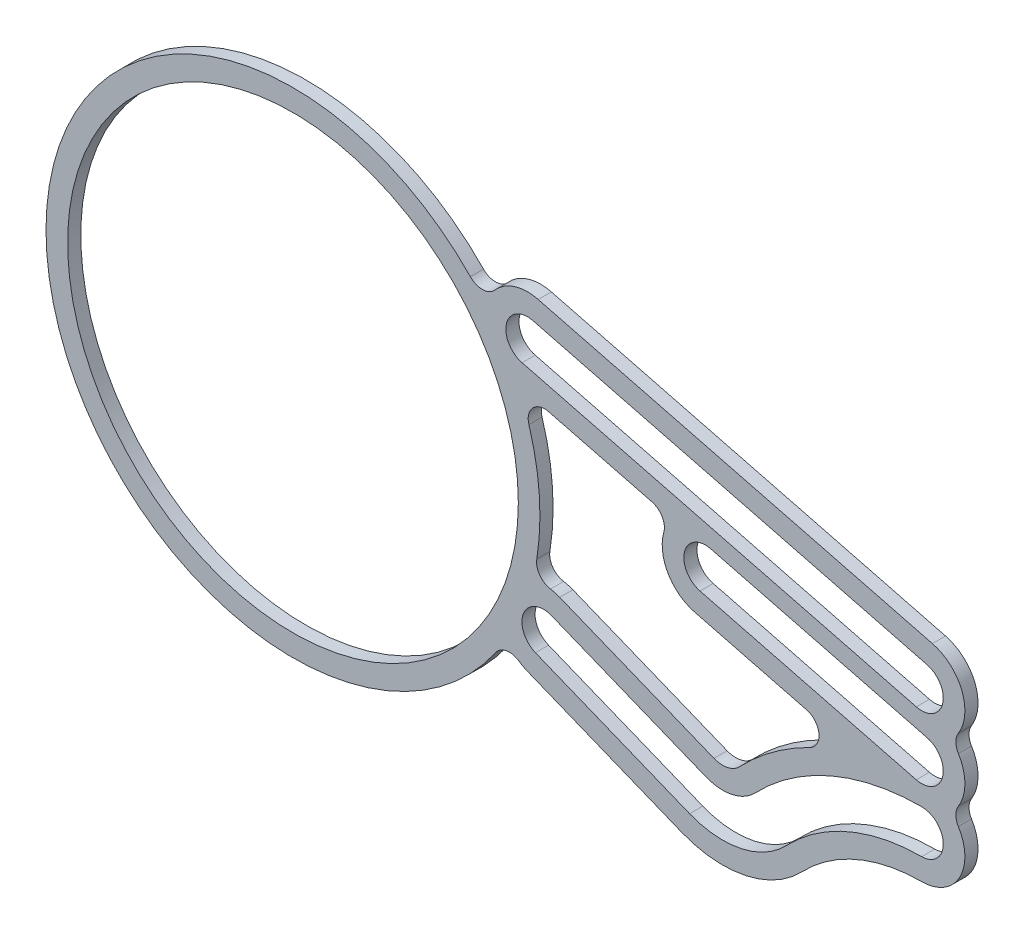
ISO-10303-21;
HEADER;
FILE_DESCRIPTION(('STEP AP214'),'2;1');
FILE_NAME('part.step','',(''),(''),'','','');
FILE_SCHEMA(('AUTOMOTIVE_DESIGN { 1 0 10303 214 1 1 1 1 }'));
ENDSEC;
DATA;
#1=APPLICATION_CONTEXT('core data for automotive mechanical design processes');
#2=APPLICATION_PROTOCOL_DEFINITION('international standard','automotive_design',2000,#1);
#3=PRODUCT_CONTEXT('',#1,'mechanical');
#4=PRODUCT('Part','Part','',(#3));
#5=PRODUCT_RELATED_PRODUCT_CATEGORY('part','',(#4));
#6=PRODUCT_DEFINITION_FORMATION('','',#4);
#7=PRODUCT_DEFINITION_CONTEXT('part definition',#1,'design');
#8=PRODUCT_DEFINITION('design','',#6,#7);
#9=PRODUCT_DEFINITION_SHAPE('','',#8);
#10=(LENGTH_UNIT() NAMED_UNIT(*) SI_UNIT(.MILLI.,.METRE.));
#11=(NAMED_UNIT(*) PLANE_ANGLE_UNIT() SI_UNIT($,.RADIAN.));
#12=(NAMED_UNIT(*) SI_UNIT($,.STERADIAN.) SOLID_ANGLE_UNIT());
#13=UNCERTAINTY_MEASURE_WITH_UNIT(LENGTH_MEASURE(1.E-05),#10,'distance_accuracy_value','');
#14=(GEOMETRIC_REPRESENTATION_CONTEXT(3) GLOBAL_UNCERTAINTY_ASSIGNED_CONTEXT((#13)) GLOBAL_UNIT_ASSIGNED_CONTEXT((#10,
#11,#12)) REPRESENTATION_CONTEXT('',''));
#15=CARTESIAN_POINT('',(0.,0.,0.));
#16=DIRECTION('',(0.,0.,1.));
#17=DIRECTION('',(1.,0.,0.));
#18=AXIS2_PLACEMENT_3D('',#15,#16,#17);
#19=CARTESIAN_POINT('',(31.2153091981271,-84.045674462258,-1.69));
#20=DIRECTION('',(0.,0.,-1.));
#21=DIRECTION('',(-1.,0.,0.));
#22=AXIS2_PLACEMENT_3D('',#19,#20,#21);
#23=PLANE('',#22);
#24=DIRECTION('',(0.968775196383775,-0.247940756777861,0.));
#25=VECTOR('',#24,1.);
#26=CARTESIAN_POINT('',(42.3553540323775,-75.3916970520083,-1.69));
#27=LINE('',#26,#25);
#28=CARTESIAN_POINT('',(42.3553540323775,-75.3916970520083,-1.69));
#29=VERTEX_POINT('',#28);
#30=CARTESIAN_POINT('',(49.0789013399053,-77.112469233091,-1.69));
#31=VERTEX_POINT('',#30);
#32=EDGE_CURVE('E443',#29,#31,#27,.T.);
#33=ORIENTED_EDGE('',*,*,#32,.F.);
#34=CARTESIAN_POINT('',(43.,-72.8728815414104,-1.69));
#35=DIRECTION('',(0.,0.,1.));
#36=DIRECTION('',(-1.,0.,0.));
#37=AXIS2_PLACEMENT_3D('',#34,#35,#36);
#38=CIRCLE('',#37,2.60000000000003);
#39=CARTESIAN_POINT('',(40.4963940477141,-72.1714849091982,-1.69));
#40=VERTEX_POINT('',#39);
#41=EDGE_CURVE('E441',#40,#29,#38,.T.);
#42=ORIENTED_EDGE('',*,*,#41,.F.);
#43=CARTESIAN_POINT('',(39.5334686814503,-71.9017169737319,-1.69));
#44=DIRECTION('',(0.,0.,-1.));
#45=DIRECTION('',(-1.,0.,0.));
#46=AXIS2_PLACEMENT_3D('',#43,#44,#45);
#47=CIRCLE('',#46,1.);
#48=CARTESIAN_POINT('',(39.7814094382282,-70.9329417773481,-1.69));
#49=VERTEX_POINT('',#48);
#50=EDGE_CURVE('E465',#49,#40,#47,.T.);
#51=ORIENTED_EDGE('',*,*,#50,.F.);
#52=DIRECTION('',(0.968775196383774,-0.247940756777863,0.));
#53=VECTOR('',#52,1.);
#54=CARTESIAN_POINT('',(33.5904061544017,-69.3484647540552,-1.69));
#55=LINE('',#54,#53);
#56=CARTESIAN_POINT('',(33.5904061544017,-69.3484647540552,-1.69));
#57=VERTEX_POINT('',#56);
#58=EDGE_CURVE('E462',#57,#49,#55,.T.);
#59=ORIENTED_EDGE('',*,*,#58,.F.);
#60=CARTESIAN_POINT('',(33.3424653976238,-70.317239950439,-1.69));
#61=DIRECTION('',(0.,0.,-1.));
#62=DIRECTION('',(-1.,0.,0.));
#63=AXIS2_PLACEMENT_3D('',#60,#61,#62);
#64=CIRCLE('',#63,0.999999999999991);
#65=CARTESIAN_POINT('',(32.3871048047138,-70.6126822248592,-1.69));
#66=VERTEX_POINT('',#65);
#67=EDGE_CURVE('E460',#66,#57,#64,.T.);
#68=ORIENTED_EDGE('',*,*,#67,.F.);
#69=CARTESIAN_POINT('',(18.2,-75.,-1.69));
#70=DIRECTION('',(0.,0.,1.));
#71=DIRECTION('',(-1.,0.,0.));
#72=AXIS2_PLACEMENT_3D('',#69,#70,#71);
#73=CIRCLE('',#72,14.85);
#74=CARTESIAN_POINT('',(32.8589488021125,-77.3743883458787,-1.69));
#75=VERTEX_POINT('',#74);
#76=EDGE_CURVE('E458',#75,#66,#73,.T.);
#77=ORIENTED_EDGE('',*,*,#76,.F.);
#78=CARTESIAN_POINT('',(33.8460834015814,-77.5342798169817,-1.69));
#79=DIRECTION('',(0.,0.,-1.));
#80=DIRECTION('',(-1.,0.,0.));
#81=AXIS2_PLACEMENT_3D('',#78,#79,#80);
#82=CIRCLE('',#81,1.);
#83=CARTESIAN_POINT('',(33.6851540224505,-78.521245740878,-1.69));
#84=VERTEX_POINT('',#83);
#85=EDGE_CURVE('E456',#84,#75,#82,.T.);
#86=ORIENTED_EDGE('',*,*,#85,.F.);
#87=CARTESIAN_POINT('',(33.2667376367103,-81.0873571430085,-1.69));
#88=DIRECTION('',(0.,0.,1.));
#89=DIRECTION('',(-1.,0.,0.));
#90=AXIS2_PLACEMENT_3D('',#87,#88,#89);
#91=CIRCLE('',#90,2.59999999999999);
#92=CARTESIAN_POINT('',(34.2407147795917,-78.6766791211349,-1.69));
#93=VERTEX_POINT('',#92);
#94=EDGE_CURVE('E454',#93,#84,#91,.T.);
#95=ORIENTED_EDGE('',*,*,#94,.F.);
#96=DIRECTION('',(-0.92718385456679,0.374606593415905,0.));
#97=VECTOR('',#96,1.);
#98=CARTESIAN_POINT('',(43.5125533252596,-82.4227450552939,-1.69));
#99=LINE('',#98,#97);
#100=CARTESIAN_POINT('',(43.5125533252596,-82.4227450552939,-1.69));
#101=VERTEX_POINT('',#100);
#102=EDGE_CURVE('E452',#101,#93,#99,.T.);
#103=ORIENTED_EDGE('',*,*,#102,.F.);
#104=CARTESIAN_POINT('',(44.0370025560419,-81.1246876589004,-1.69));
#105=DIRECTION('',(0.,0.,-1.));
#106=DIRECTION('',(-1.,0.,0.));
#107=AXIS2_PLACEMENT_3D('',#104,#105,#106);
#108=CIRCLE('',#107,1.40000000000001);
#109=CARTESIAN_POINT('',(45.0504803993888,-82.0905358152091,-1.69));
#110=VERTEX_POINT('',#109);
#111=EDGE_CURVE('E450',#110,#101,#108,.T.);
#112=ORIENTED_EDGE('',*,*,#111,.F.);
#113=CARTESIAN_POINT('',(56.,-92.5254687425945,-1.69));
#114=DIRECTION('',(0.,0.,1.));
#115=DIRECTION('',(-1.,0.,0.));
#116=AXIS2_PLACEMENT_3D('',#113,#114,#115);
#117=CIRCLE('',#116,15.1254687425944);
#118=CARTESIAN_POINT('',(49.2755392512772,-78.9769842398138,-1.69));
#119=VERTEX_POINT('',#118);
#120=EDGE_CURVE('E448',#119,#110,#117,.T.);
#121=ORIENTED_EDGE('',*,*,#120,.F.);
#122=CARTESIAN_POINT('',(48.8309605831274,-78.0812444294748,-1.69));
#123=DIRECTION('',(0.,0.,-1.));
#124=DIRECTION('',(-1.,0.,0.));
#125=AXIS2_PLACEMENT_3D('',#122,#123,#124);
#126=CIRCLE('',#125,0.999999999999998);
#127=EDGE_CURVE('E446',#31,#119,#126,.T.);
#128=ORIENTED_EDGE('',*,*,#127,.F.);
#129=EDGE_LOOP('',(#33,#42,#51,#59,#68,#77,#86,#95,#103,#112,#121,#128));
#130=FACE_BOUND('',#129,.T.);
#131=CARTESIAN_POINT('',(31.2153091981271,-84.045674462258,-1.69));
#132=DIRECTION('',(0.,0.,1.));
#133=DIRECTION('',(-1.,0.,0.));
#134=AXIS2_PLACEMENT_3D('',#131,#132,#133);
#135=CIRCLE('',#134,0.99999999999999);
#136=CARTESIAN_POINT('',(31.7851504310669,-83.2239196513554,-1.69));
#137=VERTEX_POINT('',#136);
#138=CARTESIAN_POINT('',(30.3941540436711,-83.4749694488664,-1.69));
#139=VERTEX_POINT('',#138);
#140=EDGE_CURVE('E528',#137,#139,#135,.T.);
#141=ORIENTED_EDGE('',*,*,#140,.T.);
#142=CARTESIAN_POINT('',(18.2,-75.,-1.69));
#143=DIRECTION('',(0.,0.,-1.));
#144=DIRECTION('',(-1.,0.,0.));
#145=AXIS2_PLACEMENT_3D('',#142,#143,#144);
#146=CIRCLE('',#145,14.85);
#147=CARTESIAN_POINT('',(28.8657503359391,-64.6673203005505,-1.69));
#148=VERTEX_POINT('',#147);
#149=EDGE_CURVE('E531',#139,#148,#146,.T.);
#150=ORIENTED_EDGE('',*,*,#149,.T.);
#151=CARTESIAN_POINT('',(29.5839826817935,-63.9715169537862,-1.69));
#152=DIRECTION('',(0.,0.,1.));
#153=DIRECTION('',(-1.,0.,0.));
#154=AXIS2_PLACEMENT_3D('',#151,#152,#153);
#155=CIRCLE('',#154,1.00000000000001);
#156=CARTESIAN_POINT('',(30.3384319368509,-64.6278753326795,-1.69));
#157=VERTEX_POINT('',#156);
#158=EDGE_CURVE('E534',#148,#157,#155,.T.);
#159=ORIENTED_EDGE('',*,*,#158,.T.);
#160=CARTESIAN_POINT('',(32.3,-66.334407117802,-1.69));
#161=DIRECTION('',(0.,0.,-1.));
#162=DIRECTION('',(-1.,0.,0.));
#163=AXIS2_PLACEMENT_3D('',#160,#161,#162);
#164=CIRCLE('',#163,2.60000000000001);
#165=CARTESIAN_POINT('',(32.9446459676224,-63.8155916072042,-1.69));
#166=VERTEX_POINT('',#165);
#167=EDGE_CURVE('E536',#157,#166,#164,.T.);
#168=ORIENTED_EDGE('',*,*,#167,.T.);
#169=DIRECTION('',(0.968775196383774,-0.247940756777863,0.));
#170=VECTOR('',#169,1.);
#171=CARTESIAN_POINT('',(32.9446459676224,-63.8155916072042,-1.69));
#172=LINE('',#171,#170);
#173=CARTESIAN_POINT('',(56.6446459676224,-69.8811844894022,-1.69));
#174=VERTEX_POINT('',#173);
#175=EDGE_CURVE('E538',#166,#174,#172,.T.);
#176=ORIENTED_EDGE('',*,*,#175,.T.);
#177=CARTESIAN_POINT('',(56.,-72.4,-1.69));
#178=DIRECTION('',(0.,0.,-1.));
#179=DIRECTION('',(-1.,0.,0.));
#180=AXIS2_PLACEMENT_3D('',#177,#178,#179);
#181=CIRCLE('',#180,2.60000000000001);
#182=CARTESIAN_POINT('',(58.2083944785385,-73.7722222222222,-1.69));
#183=VERTEX_POINT('',#182);
#184=EDGE_CURVE('E540',#174,#183,#181,.T.);
#185=ORIENTED_EDGE('',*,*,#184,.T.);
#186=CARTESIAN_POINT('',(59.0577769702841,-74.3,-1.69));
#187=DIRECTION('',(0.,0.,1.));
#188=DIRECTION('',(-1.,0.,0.));
#189=AXIS2_PLACEMENT_3D('',#186,#187,#188);
#190=CIRCLE('',#189,1.);
#191=CARTESIAN_POINT('',(58.2083944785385,-74.8277777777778,-1.69));
#192=VERTEX_POINT('',#191);
#193=EDGE_CURVE('E542',#183,#192,#190,.T.);
#194=ORIENTED_EDGE('',*,*,#193,.T.);
#195=CARTESIAN_POINT('',(56.,-76.2,-1.69));
#196=DIRECTION('',(0.,0.,-1.));
#197=DIRECTION('',(-1.,0.,0.));
#198=AXIS2_PLACEMENT_3D('',#195,#196,#197);
#199=CIRCLE('',#198,2.6);
#200=CARTESIAN_POINT('',(58.2083944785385,-77.5722222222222,-1.69));
#201=VERTEX_POINT('',#200);
#202=EDGE_CURVE('E544',#192,#201,#199,.T.);
#203=ORIENTED_EDGE('',*,*,#202,.T.);
#204=CARTESIAN_POINT('',(59.0577769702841,-78.1,-1.69));
#205=DIRECTION('',(0.,0.,1.));
#206=DIRECTION('',(-1.,0.,0.));
#207=AXIS2_PLACEMENT_3D('',#204,#205,#206);
#208=CIRCLE('',#207,1.);
#209=CARTESIAN_POINT('',(58.2083944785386,-78.6277777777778,-1.69));
#210=VERTEX_POINT('',#209);
#211=EDGE_CURVE('E546',#201,#210,#208,.T.);
#212=ORIENTED_EDGE('',*,*,#211,.T.);
#213=CARTESIAN_POINT('',(56.,-80.,-1.69));
#214=DIRECTION('',(0.,0.,-1.));
#215=DIRECTION('',(-1.,0.,0.));
#216=AXIS2_PLACEMENT_3D('',#213,#214,#215);
#217=CIRCLE('',#216,2.60000000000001);
#218=CARTESIAN_POINT('',(56.,-82.6,-1.69));
#219=VERTEX_POINT('',#218);
#220=EDGE_CURVE('E548',#210,#219,#217,.T.);
#221=ORIENTED_EDGE('',*,*,#220,.T.);
#222=CARTESIAN_POINT('',(56.,-92.5254687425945,-1.69));
#223=DIRECTION('',(0.,0.,1.));
#224=DIRECTION('',(-1.,0.,0.));
#225=AXIS2_PLACEMENT_3D('',#222,#223,#224);
#226=CIRCLE('',#225,9.92546874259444);
#227=CARTESIAN_POINT('',(48.8148266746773,-85.6779718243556,-1.69));
#228=VERTEX_POINT('',#227);
#229=EDGE_CURVE('E550',#219,#228,#226,.T.);
#230=ORIENTED_EDGE('',*,*,#229,.T.);
#231=CARTESIAN_POINT('',(44.0370025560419,-81.1246876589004,-1.69));
#232=DIRECTION('',(0.,0.,-1.));
#233=DIRECTION('',(-1.,0.,0.));
#234=AXIS2_PLACEMENT_3D('',#231,#232,#233);
#235=CIRCLE('',#234,6.60000000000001);
#236=CARTESIAN_POINT('',(41.5645990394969,-87.2441010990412,-1.69));
#237=VERTEX_POINT('',#236);
#238=EDGE_CURVE('E552',#228,#237,#235,.T.);
#239=ORIENTED_EDGE('',*,*,#238,.T.);
#240=DIRECTION('',(-0.92718385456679,0.374606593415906,0.));
#241=VECTOR('',#240,1.);
#242=CARTESIAN_POINT('',(41.5645990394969,-87.2441010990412,-1.69));
#243=LINE('',#242,#241);
#244=CARTESIAN_POINT('',(32.292760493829,-83.4980351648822,-1.69));
#245=VERTEX_POINT('',#244);
#246=EDGE_CURVE('E554',#237,#245,#243,.T.);
#247=ORIENTED_EDGE('',*,*,#246,.T.);
#248=CARTESIAN_POINT('',(33.2667376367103,-81.0873571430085,-1.69));
#249=DIRECTION('',(0.,0.,-1.));
#250=DIRECTION('',(-1.,0.,0.));
#251=AXIS2_PLACEMENT_3D('',#248,#249,#250);
#252=CIRCLE('',#251,2.6);
#253=EDGE_CURVE('E556',#245,#137,#252,.T.);
#254=ORIENTED_EDGE('',*,*,#253,.T.);
#255=EDGE_LOOP('',(#141,#150,#159,#168,#176,#185,#194,#203,#212,#221,#230,#239,#247,#254));
#256=FACE_BOUND('',#255,.T.);
#257=CARTESIAN_POINT('',(18.2,-75.,-1.69));
#258=DIRECTION('',(0.,0.,-1.));
#259=DIRECTION('',(-1.,0.,0.));
#260=AXIS2_PLACEMENT_3D('',#257,#258,#259);
#261=CIRCLE('',#260,13.55);
#262=CARTESIAN_POINT('',(31.75,-75.,-1.69));
#263=VERTEX_POINT('',#262);
#264=EDGE_CURVE('E435',#263,#263,#261,.T.);
#265=ORIENTED_EDGE('',*,*,#264,.F.);
#266=EDGE_LOOP('',(#265));
#267=FACE_BOUND('',#266,.T.);
#268=DIRECTION('',(0.968775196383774,-0.247940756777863,0.));
#269=VECTOR('',#268,1.);
#270=CARTESIAN_POINT('',(43.3223229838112,-71.6134737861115,-1.69));
#271=LINE('',#270,#269);
#272=CARTESIAN_POINT('',(43.3223229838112,-71.6134737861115,-1.69));
#273=VERTEX_POINT('',#272);
#274=CARTESIAN_POINT('',(56.3223229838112,-74.9405922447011,-1.69));
#275=VERTEX_POINT('',#274);
#276=EDGE_CURVE('E406',#273,#275,#271,.T.);
#277=ORIENTED_EDGE('',*,*,#276,.F.);
#278=CARTESIAN_POINT('',(43.,-72.8728815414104,-1.69));
#279=DIRECTION('',(0.,0.,-1.));
#280=DIRECTION('',(-1.,0.,0.));
#281=AXIS2_PLACEMENT_3D('',#278,#279,#280);
#282=CIRCLE('',#281,1.30000000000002);
#283=CARTESIAN_POINT('',(42.6776770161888,-74.1322892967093,-1.69));
#284=VERTEX_POINT('',#283);
#285=EDGE_CURVE('E404',#284,#273,#282,.T.);
#286=ORIENTED_EDGE('',*,*,#285,.F.);
#287=DIRECTION('',(-0.968775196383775,0.247940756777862,0.));
#288=VECTOR('',#287,1.);
#289=CARTESIAN_POINT('',(55.6776770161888,-77.4594077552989,-1.69));
#290=LINE('',#289,#288);
#291=CARTESIAN_POINT('',(55.6776770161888,-77.4594077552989,-1.69));
#292=VERTEX_POINT('',#291);
#293=EDGE_CURVE('E412',#292,#284,#290,.T.);
#294=ORIENTED_EDGE('',*,*,#293,.F.);
#295=CARTESIAN_POINT('',(56.,-76.2,-1.69));
#296=DIRECTION('',(0.,0.,-1.));
#297=DIRECTION('',(-1.,0.,0.));
#298=AXIS2_PLACEMENT_3D('',#295,#296,#297);
#299=CIRCLE('',#298,1.30000000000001);
#300=EDGE_CURVE('E409',#275,#292,#299,.T.);
#301=ORIENTED_EDGE('',*,*,#300,.F.);
#302=EDGE_LOOP('',(#277,#286,#294,#301));
#303=FACE_BOUND('',#302,.T.);
#304=DIRECTION('',(-0.968775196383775,0.247940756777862,0.));
#305=VECTOR('',#304,1.);
#306=CARTESIAN_POINT('',(55.6776770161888,-73.6594077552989,-1.69));
#307=LINE('',#306,#305);
#308=CARTESIAN_POINT('',(55.6776770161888,-73.6594077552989,-1.69));
#309=VERTEX_POINT('',#308);
#310=CARTESIAN_POINT('',(31.9776770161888,-67.593814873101,-1.69));
#311=VERTEX_POINT('',#310);
#312=EDGE_CURVE('E375',#309,#311,#307,.T.);
#313=ORIENTED_EDGE('',*,*,#312,.F.);
#314=CARTESIAN_POINT('',(56.,-72.4,-1.69));
#315=DIRECTION('',(0.,0.,-1.));
#316=DIRECTION('',(-1.,0.,0.));
#317=AXIS2_PLACEMENT_3D('',#314,#315,#316);
#318=CIRCLE('',#317,1.3);
#319=CARTESIAN_POINT('',(56.3223229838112,-71.1405922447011,-1.69));
#320=VERTEX_POINT('',#319);
#321=EDGE_CURVE('E373',#320,#309,#318,.T.);
#322=ORIENTED_EDGE('',*,*,#321,.F.);
#323=DIRECTION('',(0.968775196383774,-0.247940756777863,0.));
#324=VECTOR('',#323,1.);
#325=CARTESIAN_POINT('',(32.6223229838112,-65.0749993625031,-1.69));
#326=LINE('',#325,#324);
#327=CARTESIAN_POINT('',(32.6223229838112,-65.0749993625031,-1.69));
#328=VERTEX_POINT('',#327);
#329=EDGE_CURVE('E381',#328,#320,#326,.T.);
#330=ORIENTED_EDGE('',*,*,#329,.F.);
#331=CARTESIAN_POINT('',(32.3,-66.334407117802,-1.69));
#332=DIRECTION('',(0.,0.,-1.));
#333=DIRECTION('',(-1.,0.,0.));
#334=AXIS2_PLACEMENT_3D('',#331,#332,#333);
#335=CIRCLE('',#334,1.30000000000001);
#336=EDGE_CURVE('E378',#311,#328,#335,.T.);
#337=ORIENTED_EDGE('',*,*,#336,.F.);
#338=EDGE_LOOP('',(#313,#322,#330,#337));
#339=FACE_BOUND('',#338,.T.);
#340=CARTESIAN_POINT('',(56.,-80.,-1.69));
#341=DIRECTION('',(0.,0.,-1.));
#342=DIRECTION('',(-1.,0.,0.));
#343=AXIS2_PLACEMENT_3D('',#340,#341,#342);
#344=CIRCLE('',#343,1.29999999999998);
#345=CARTESIAN_POINT('',(56.,-78.7,-1.69));
#346=VERTEX_POINT('',#345);
#347=CARTESIAN_POINT('',(56.,-81.3,-1.69));
#348=VERTEX_POINT('',#347);
#349=EDGE_CURVE('E316',#346,#348,#344,.T.);
#350=ORIENTED_EDGE('',*,*,#349,.F.);
#351=CARTESIAN_POINT('',(56.,-92.5254687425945,-1.69));
#352=DIRECTION('',(0.,0.,-1.));
#353=DIRECTION('',(-1.,0.,0.));
#354=AXIS2_PLACEMENT_3D('',#351,#352,#353);
#355=CIRCLE('',#354,13.8254687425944);
#356=CARTESIAN_POINT('',(45.9915669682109,-82.9873948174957,-1.69));
#357=VERTEX_POINT('',#356);
#358=EDGE_CURVE('E308',#357,#346,#355,.T.);
#359=ORIENTED_EDGE('',*,*,#358,.F.);
#360=CARTESIAN_POINT('',(44.0370025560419,-81.1246876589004,-1.69));
#361=DIRECTION('',(0.,0.,1.));
#362=DIRECTION('',(-1.,0.,0.));
#363=AXIS2_PLACEMENT_3D('',#360,#361,#362);
#364=CIRCLE('',#363,2.70000000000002);
#365=CARTESIAN_POINT('',(43.0255647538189,-83.6280840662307,-1.69));
#366=VERTEX_POINT('',#365);
#367=EDGE_CURVE('E341',#366,#357,#364,.T.);
#368=ORIENTED_EDGE('',*,*,#367,.F.);
#369=DIRECTION('',(0.92718385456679,-0.374606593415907,0.));
#370=VECTOR('',#369,1.);
#371=CARTESIAN_POINT('',(33.753726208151,-79.8820181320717,-1.69));
#372=LINE('',#371,#370);
#373=CARTESIAN_POINT('',(33.753726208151,-79.8820181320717,-1.69));
#374=VERTEX_POINT('',#373);
#375=EDGE_CURVE('E339',#374,#366,#372,.T.);
#376=ORIENTED_EDGE('',*,*,#375,.F.);
#377=CARTESIAN_POINT('',(33.2667376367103,-81.0873571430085,-1.69));
#378=DIRECTION('',(0.,0.,-1.));
#379=DIRECTION('',(-1.,0.,0.));
#380=AXIS2_PLACEMENT_3D('',#377,#378,#379);
#381=CIRCLE('',#380,1.29999999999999);
#382=CARTESIAN_POINT('',(32.7797490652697,-82.2926961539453,-1.69));
#383=VERTEX_POINT('',#382);
#384=EDGE_CURVE('E337',#383,#374,#381,.T.);
#385=ORIENTED_EDGE('',*,*,#384,.F.);
#386=DIRECTION('',(-0.92718385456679,0.374606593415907,0.));
#387=VECTOR('',#386,1.);
#388=CARTESIAN_POINT('',(42.0515876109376,-86.0387620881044,-1.69));
#389=LINE('',#388,#387);
#390=CARTESIAN_POINT('',(42.0515876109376,-86.0387620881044,-1.69));
#391=VERTEX_POINT('',#390);
#392=EDGE_CURVE('E335',#391,#383,#389,.T.);
#393=ORIENTED_EDGE('',*,*,#392,.F.);
#394=CARTESIAN_POINT('',(44.0370025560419,-81.1246876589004,-1.69));
#395=DIRECTION('',(0.,0.,-1.));
#396=DIRECTION('',(-1.,0.,0.));
#397=AXIS2_PLACEMENT_3D('',#394,#395,#396);
#398=CIRCLE('',#397,5.3);
#399=CARTESIAN_POINT('',(47.8737401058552,-84.781112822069,-1.69));
#400=VERTEX_POINT('',#399);
#401=EDGE_CURVE('E331',#400,#391,#398,.T.);
#402=ORIENTED_EDGE('',*,*,#401,.F.);
#403=CARTESIAN_POINT('',(56.,-92.5254687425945,-1.69));
#404=DIRECTION('',(0.,0.,1.));
#405=DIRECTION('',(-1.,0.,0.));
#406=AXIS2_PLACEMENT_3D('',#403,#404,#405);
#407=CIRCLE('',#406,11.2254687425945);
#408=EDGE_CURVE('E329',#348,#400,#407,.T.);
#409=ORIENTED_EDGE('',*,*,#408,.F.);
#410=EDGE_LOOP('',(#350,#359,#368,#376,#385,#393,#402,#409));
#411=FACE_BOUND('',#410,.T.);
#412=ADVANCED_FACE('F39',(#130,#256,#267,#303,#339,#411),#23,.T.);
#413=CARTESIAN_POINT('',(31.2153091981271,-84.045674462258,-0.9));
#414=DIRECTION('',(0.,0.,-1.));
#415=DIRECTION('',(-1.,0.,0.));
#416=AXIS2_PLACEMENT_3D('',#413,#414,#415);
#417=PLANE('',#416);
#418=CARTESIAN_POINT('',(56.,-72.4,-0.9));
#419=DIRECTION('',(0.,0.,-1.));
#420=DIRECTION('',(-1.,0.,0.));
#421=AXIS2_PLACEMENT_3D('',#418,#419,#420);
#422=CIRCLE('',#421,1.3);
#423=CARTESIAN_POINT('',(56.3223229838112,-71.1405922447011,-0.9));
#424=VERTEX_POINT('',#423);
#425=CARTESIAN_POINT('',(55.6776770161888,-73.6594077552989,-0.9));
#426=VERTEX_POINT('',#425);
#427=EDGE_CURVE('E324',#424,#426,#422,.T.);
#428=ORIENTED_EDGE('',*,*,#427,.T.);
#429=DIRECTION('',(-0.968775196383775,0.247940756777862,0.));
#430=VECTOR('',#429,1.);
#431=CARTESIAN_POINT('',(55.6776770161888,-73.6594077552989,-0.9));
#432=LINE('',#431,#430);
#433=CARTESIAN_POINT('',(31.9776770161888,-67.593814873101,-0.9));
#434=VERTEX_POINT('',#433);
#435=EDGE_CURVE('E386',#426,#434,#432,.T.);
#436=ORIENTED_EDGE('',*,*,#435,.T.);
#437=CARTESIAN_POINT('',(32.3,-66.334407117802,-0.9));
#438=DIRECTION('',(0.,0.,-1.));
#439=DIRECTION('',(-1.,0.,0.));
#440=AXIS2_PLACEMENT_3D('',#437,#438,#439);
#441=CIRCLE('',#440,1.30000000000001);
#442=CARTESIAN_POINT('',(32.6223229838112,-65.0749993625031,-0.9));
#443=VERTEX_POINT('',#442);
#444=EDGE_CURVE('E389',#434,#443,#441,.T.);
#445=ORIENTED_EDGE('',*,*,#444,.T.);
#446=DIRECTION('',(0.968775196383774,-0.247940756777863,0.));
#447=VECTOR('',#446,1.);
#448=CARTESIAN_POINT('',(32.6223229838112,-65.0749993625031,-0.9));
#449=LINE('',#448,#447);
#450=EDGE_CURVE('E376',#443,#424,#449,.T.);
#451=ORIENTED_EDGE('',*,*,#450,.T.);
#452=EDGE_LOOP('',(#428,#436,#445,#451));
#453=FACE_BOUND('',#452,.T.);
#454=CARTESIAN_POINT('',(18.2,-75.,-0.9));
#455=DIRECTION('',(0.,0.,-1.));
#456=DIRECTION('',(-1.,0.,0.));
#457=AXIS2_PLACEMENT_3D('',#454,#455,#456);
#458=CIRCLE('',#457,13.55);
#459=CARTESIAN_POINT('',(31.75,-75.,-0.9));
#460=VERTEX_POINT('',#459);
#461=EDGE_CURVE('E434',#460,#460,#458,.T.);
#462=ORIENTED_EDGE('',*,*,#461,.T.);
#463=EDGE_LOOP('',(#462));
#464=FACE_BOUND('',#463,.T.);
#465=CARTESIAN_POINT('',(43.,-72.8728815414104,-0.9));
#466=DIRECTION('',(0.,0.,1.));
#467=DIRECTION('',(-1.,0.,0.));
#468=AXIS2_PLACEMENT_3D('',#465,#466,#467);
#469=CIRCLE('',#468,2.60000000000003);
#470=CARTESIAN_POINT('',(40.4963940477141,-72.1714849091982,-0.9));
#471=VERTEX_POINT('',#470);
#472=CARTESIAN_POINT('',(42.3553540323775,-75.3916970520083,-0.9));
#473=VERTEX_POINT('',#472);
#474=EDGE_CURVE('E438',#471,#473,#469,.T.);
#475=ORIENTED_EDGE('',*,*,#474,.T.);
#476=DIRECTION('',(0.968775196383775,-0.247940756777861,0.));
#477=VECTOR('',#476,1.);
#478=CARTESIAN_POINT('',(42.3553540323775,-75.3916970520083,-0.9));
#479=LINE('',#478,#477);
#480=CARTESIAN_POINT('',(49.0789013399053,-77.112469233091,-0.9));
#481=VERTEX_POINT('',#480);
#482=EDGE_CURVE('E470',#473,#481,#479,.T.);
#483=ORIENTED_EDGE('',*,*,#482,.T.);
#484=CARTESIAN_POINT('',(48.8309605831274,-78.0812444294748,-0.9));
#485=DIRECTION('',(0.,0.,-1.));
#486=DIRECTION('',(-1.,0.,0.));
#487=AXIS2_PLACEMENT_3D('',#484,#485,#486);
#488=CIRCLE('',#487,0.999999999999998);
#489=CARTESIAN_POINT('',(49.2755392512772,-78.9769842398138,-0.9));
#490=VERTEX_POINT('',#489);
#491=EDGE_CURVE('E473',#481,#490,#488,.T.);
#492=ORIENTED_EDGE('',*,*,#491,.T.);
#493=CARTESIAN_POINT('',(56.,-92.5254687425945,-0.9));
#494=DIRECTION('',(0.,0.,1.));
#495=DIRECTION('',(-1.,0.,0.));
#496=AXIS2_PLACEMENT_3D('',#493,#494,#495);
#497=CIRCLE('',#496,15.1254687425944);
#498=CARTESIAN_POINT('',(45.0504803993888,-82.0905358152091,-0.9));
#499=VERTEX_POINT('',#498);
#500=EDGE_CURVE('E476',#490,#499,#497,.T.);
#501=ORIENTED_EDGE('',*,*,#500,.T.);
#502=CARTESIAN_POINT('',(44.0370025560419,-81.1246876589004,-0.9));
#503=DIRECTION('',(0.,0.,-1.));
#504=DIRECTION('',(-1.,0.,0.));
#505=AXIS2_PLACEMENT_3D('',#502,#503,#504);
#506=CIRCLE('',#505,1.40000000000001);
#507=CARTESIAN_POINT('',(43.5125533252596,-82.4227450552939,-0.9));
#508=VERTEX_POINT('',#507);
#509=EDGE_CURVE('E479',#499,#508,#506,.T.);
#510=ORIENTED_EDGE('',*,*,#509,.T.);
#511=DIRECTION('',(-0.92718385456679,0.374606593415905,0.));
#512=VECTOR('',#511,1.);
#513=CARTESIAN_POINT('',(43.5125533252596,-82.4227450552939,-0.9));
#514=LINE('',#513,#512);
#515=CARTESIAN_POINT('',(34.2407147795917,-78.6766791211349,-0.9));
#516=VERTEX_POINT('',#515);
#517=EDGE_CURVE('E482',#508,#516,#514,.T.);
#518=ORIENTED_EDGE('',*,*,#517,.T.);
#519=CARTESIAN_POINT('',(33.2667376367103,-81.0873571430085,-0.9));
#520=DIRECTION('',(0.,0.,1.));
#521=DIRECTION('',(-1.,0.,0.));
#522=AXIS2_PLACEMENT_3D('',#519,#520,#521);
#523=CIRCLE('',#522,2.59999999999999);
#524=CARTESIAN_POINT('',(33.6851540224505,-78.521245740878,-0.9));
#525=VERTEX_POINT('',#524);
#526=EDGE_CURVE('E485',#516,#525,#523,.T.);
#527=ORIENTED_EDGE('',*,*,#526,.T.);
#528=CARTESIAN_POINT('',(33.8460834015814,-77.5342798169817,-0.9));
#529=DIRECTION('',(0.,0.,-1.));
#530=DIRECTION('',(-1.,0.,0.));
#531=AXIS2_PLACEMENT_3D('',#528,#529,#530);
#532=CIRCLE('',#531,1.);
#533=CARTESIAN_POINT('',(32.8589488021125,-77.3743883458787,-0.9));
#534=VERTEX_POINT('',#533);
#535=EDGE_CURVE('E488',#525,#534,#532,.T.);
#536=ORIENTED_EDGE('',*,*,#535,.T.);
#537=CARTESIAN_POINT('',(18.2,-75.,-0.9));
#538=DIRECTION('',(0.,0.,1.));
#539=DIRECTION('',(-1.,0.,0.));
#540=AXIS2_PLACEMENT_3D('',#537,#538,#539);
#541=CIRCLE('',#540,14.85);
#542=CARTESIAN_POINT('',(32.3871048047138,-70.6126822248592,-0.9));
#543=VERTEX_POINT('',#542);
#544=EDGE_CURVE('E491',#534,#543,#541,.T.);
#545=ORIENTED_EDGE('',*,*,#544,.T.);
#546=CARTESIAN_POINT('',(33.3424653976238,-70.317239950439,-0.9));
#547=DIRECTION('',(0.,0.,-1.));
#548=DIRECTION('',(-1.,0.,0.));
#549=AXIS2_PLACEMENT_3D('',#546,#547,#548);
#550=CIRCLE('',#549,0.999999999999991);
#551=CARTESIAN_POINT('',(33.5904061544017,-69.3484647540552,-0.9));
#552=VERTEX_POINT('',#551);
#553=EDGE_CURVE('E494',#543,#552,#550,.T.);
#554=ORIENTED_EDGE('',*,*,#553,.T.);
#555=DIRECTION('',(0.968775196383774,-0.247940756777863,0.));
#556=VECTOR('',#555,1.);
#557=CARTESIAN_POINT('',(33.5904061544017,-69.3484647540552,-0.9));
#558=LINE('',#557,#556);
#559=CARTESIAN_POINT('',(39.7814094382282,-70.9329417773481,-0.9));
#560=VERTEX_POINT('',#559);
#561=EDGE_CURVE('E497',#552,#560,#558,.T.);
#562=ORIENTED_EDGE('',*,*,#561,.T.);
#563=CARTESIAN_POINT('',(39.5334686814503,-71.9017169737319,-0.9));
#564=DIRECTION('',(0.,0.,-1.));
#565=DIRECTION('',(-1.,0.,0.));
#566=AXIS2_PLACEMENT_3D('',#563,#564,#565);
#567=CIRCLE('',#566,1.);
#568=EDGE_CURVE('E444',#560,#471,#567,.T.);
#569=ORIENTED_EDGE('',*,*,#568,.T.);
#570=EDGE_LOOP('',(#475,#483,#492,#501,#510,#518,#527,#536,#545,#554,#562,#569));
#571=FACE_BOUND('',#570,.T.);
#572=CARTESIAN_POINT('',(31.2153091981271,-84.045674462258,-0.9));
#573=DIRECTION('',(0.,0.,1.));
#574=DIRECTION('',(-1.,0.,0.));
#575=AXIS2_PLACEMENT_3D('',#572,#573,#574);
#576=CIRCLE('',#575,0.99999999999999);
#577=CARTESIAN_POINT('',(31.7851504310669,-83.2239196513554,-0.9));
#578=VERTEX_POINT('',#577);
#579=CARTESIAN_POINT('',(30.3941540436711,-83.4749694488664,-0.9));
#580=VERTEX_POINT('',#579);
#581=EDGE_CURVE('E527',#578,#580,#576,.T.);
#582=ORIENTED_EDGE('',*,*,#581,.F.);
#583=CARTESIAN_POINT('',(33.2667376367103,-81.0873571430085,-0.9));
#584=DIRECTION('',(0.,0.,-1.));
#585=DIRECTION('',(-1.,0.,0.));
#586=AXIS2_PLACEMENT_3D('',#583,#584,#585);
#587=CIRCLE('',#586,2.6);
#588=CARTESIAN_POINT('',(32.292760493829,-83.4980351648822,-0.9));
#589=VERTEX_POINT('',#588);
#590=EDGE_CURVE('E532',#589,#578,#587,.T.);
#591=ORIENTED_EDGE('',*,*,#590,.F.);
#592=DIRECTION('',(-0.92718385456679,0.374606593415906,0.));
#593=VECTOR('',#592,1.);
#594=CARTESIAN_POINT('',(41.5645990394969,-87.2441010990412,-0.9));
#595=LINE('',#594,#593);
#596=CARTESIAN_POINT('',(41.5645990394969,-87.2441010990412,-0.9));
#597=VERTEX_POINT('',#596);
#598=EDGE_CURVE('E583',#597,#589,#595,.T.);
#599=ORIENTED_EDGE('',*,*,#598,.F.);
#600=CARTESIAN_POINT('',(44.0370025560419,-81.1246876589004,-0.9));
#601=DIRECTION('',(0.,0.,-1.));
#602=DIRECTION('',(-1.,0.,0.));
#603=AXIS2_PLACEMENT_3D('',#600,#601,#602);
#604=CIRCLE('',#603,6.60000000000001);
#605=CARTESIAN_POINT('',(48.8148266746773,-85.6779718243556,-0.9));
#606=VERTEX_POINT('',#605);
#607=EDGE_CURVE('E581',#606,#597,#604,.T.);
#608=ORIENTED_EDGE('',*,*,#607,.F.);
#609=CARTESIAN_POINT('',(56.,-92.5254687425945,-0.9));
#610=DIRECTION('',(0.,0.,1.));
#611=DIRECTION('',(-1.,0.,0.));
#612=AXIS2_PLACEMENT_3D('',#609,#610,#611);
#613=CIRCLE('',#612,9.92546874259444);
#614=CARTESIAN_POINT('',(56.,-82.6,-0.9));
#615=VERTEX_POINT('',#614);
#616=EDGE_CURVE('E579',#615,#606,#613,.T.);
#617=ORIENTED_EDGE('',*,*,#616,.F.);
#618=CARTESIAN_POINT('',(56.,-80.,-0.9));
#619=DIRECTION('',(0.,0.,-1.));
#620=DIRECTION('',(-1.,0.,0.));
#621=AXIS2_PLACEMENT_3D('',#618,#619,#620);
#622=CIRCLE('',#621,2.60000000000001);
#623=CARTESIAN_POINT('',(58.2083944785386,-78.6277777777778,-0.9));
#624=VERTEX_POINT('',#623);
#625=EDGE_CURVE('E577',#624,#615,#622,.T.);
#626=ORIENTED_EDGE('',*,*,#625,.F.);
#627=CARTESIAN_POINT('',(59.0577769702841,-78.1,-0.9));
#628=DIRECTION('',(0.,0.,1.));
#629=DIRECTION('',(-1.,0.,0.));
#630=AXIS2_PLACEMENT_3D('',#627,#628,#629);
#631=CIRCLE('',#630,1.);
#632=CARTESIAN_POINT('',(58.2083944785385,-77.5722222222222,-0.9));
#633=VERTEX_POINT('',#632);
#634=EDGE_CURVE('E575',#633,#624,#631,.T.);
#635=ORIENTED_EDGE('',*,*,#634,.F.);
#636=CARTESIAN_POINT('',(56.,-76.2,-0.9));
#637=DIRECTION('',(0.,0.,-1.));
#638=DIRECTION('',(-1.,0.,0.));
#639=AXIS2_PLACEMENT_3D('',#636,#637,#638);
#640=CIRCLE('',#639,2.6);
#641=CARTESIAN_POINT('',(58.2083944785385,-74.8277777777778,-0.9));
#642=VERTEX_POINT('',#641);
#643=EDGE_CURVE('E573',#642,#633,#640,.T.);
#644=ORIENTED_EDGE('',*,*,#643,.F.);
#645=CARTESIAN_POINT('',(59.0577769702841,-74.3,-0.9));
#646=DIRECTION('',(0.,0.,1.));
#647=DIRECTION('',(-1.,0.,0.));
#648=AXIS2_PLACEMENT_3D('',#645,#646,#647);
#649=CIRCLE('',#648,1.);
#650=CARTESIAN_POINT('',(58.2083944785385,-73.7722222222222,-0.9));
#651=VERTEX_POINT('',#650);
#652=EDGE_CURVE('E571',#651,#642,#649,.T.);
#653=ORIENTED_EDGE('',*,*,#652,.F.);
#654=CARTESIAN_POINT('',(56.,-72.4,-0.9));
#655=DIRECTION('',(0.,0.,-1.));
#656=DIRECTION('',(-1.,0.,0.));
#657=AXIS2_PLACEMENT_3D('',#654,#655,#656);
#658=CIRCLE('',#657,2.60000000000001);
#659=CARTESIAN_POINT('',(56.6446459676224,-69.8811844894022,-0.9));
#660=VERTEX_POINT('',#659);
#661=EDGE_CURVE('E569',#660,#651,#658,.T.);
#662=ORIENTED_EDGE('',*,*,#661,.F.);
#663=DIRECTION('',(0.968775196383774,-0.247940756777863,0.));
#664=VECTOR('',#663,1.);
#665=CARTESIAN_POINT('',(32.9446459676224,-63.8155916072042,-0.9));
#666=LINE('',#665,#664);
#667=CARTESIAN_POINT('',(32.9446459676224,-63.8155916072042,-0.9));
#668=VERTEX_POINT('',#667);
#669=EDGE_CURVE('E567',#668,#660,#666,.T.);
#670=ORIENTED_EDGE('',*,*,#669,.F.);
#671=CARTESIAN_POINT('',(32.3,-66.334407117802,-0.9));
#672=DIRECTION('',(0.,0.,-1.));
#673=DIRECTION('',(-1.,0.,0.));
#674=AXIS2_PLACEMENT_3D('',#671,#672,#673);
#675=CIRCLE('',#674,2.60000000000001);
#676=CARTESIAN_POINT('',(30.3384319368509,-64.6278753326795,-0.9));
#677=VERTEX_POINT('',#676);
#678=EDGE_CURVE('E565',#677,#668,#675,.T.);
#679=ORIENTED_EDGE('',*,*,#678,.F.);
#680=CARTESIAN_POINT('',(29.5839826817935,-63.9715169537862,-0.9));
#681=DIRECTION('',(0.,0.,1.));
#682=DIRECTION('',(-1.,0.,0.));
#683=AXIS2_PLACEMENT_3D('',#680,#681,#682);
#684=CIRCLE('',#683,1.00000000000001);
#685=CARTESIAN_POINT('',(28.8657503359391,-64.6673203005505,-0.9));
#686=VERTEX_POINT('',#685);
#687=EDGE_CURVE('E563',#686,#677,#684,.T.);
#688=ORIENTED_EDGE('',*,*,#687,.F.);
#689=CARTESIAN_POINT('',(18.2,-75.,-0.9));
#690=DIRECTION('',(0.,0.,-1.));
#691=DIRECTION('',(-1.,0.,0.));
#692=AXIS2_PLACEMENT_3D('',#689,#690,#691);
#693=CIRCLE('',#692,14.85);
#694=EDGE_CURVE('E561',#580,#686,#693,.T.);
#695=ORIENTED_EDGE('',*,*,#694,.F.);
#696=EDGE_LOOP('',(#582,#591,#599,#608,#617,#626,#635,#644,#653,#662,#670,#679,#688,#695));
#697=FACE_BOUND('',#696,.T.);
#698=CARTESIAN_POINT('',(43.,-72.8728815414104,-0.9));
#699=DIRECTION('',(0.,0.,-1.));
#700=DIRECTION('',(-1.,0.,0.));
#701=AXIS2_PLACEMENT_3D('',#698,#699,#700);
#702=CIRCLE('',#701,1.30000000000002);
#703=CARTESIAN_POINT('',(42.6776770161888,-74.1322892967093,-0.9));
#704=VERTEX_POINT('',#703);
#705=CARTESIAN_POINT('',(43.3223229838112,-71.6134737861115,-0.9));
#706=VERTEX_POINT('',#705);
#707=EDGE_CURVE('E403',#704,#706,#702,.T.);
#708=ORIENTED_EDGE('',*,*,#707,.T.);
#709=DIRECTION('',(0.968775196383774,-0.247940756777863,0.));
#710=VECTOR('',#709,1.);
#711=CARTESIAN_POINT('',(43.3223229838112,-71.6134737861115,-0.9));
#712=LINE('',#711,#710);
#713=CARTESIAN_POINT('',(56.3223229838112,-74.9405922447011,-0.9));
#714=VERTEX_POINT('',#713);
#715=EDGE_CURVE('E417',#706,#714,#712,.T.);
#716=ORIENTED_EDGE('',*,*,#715,.T.);
#717=CARTESIAN_POINT('',(56.,-76.2,-0.9));
#718=DIRECTION('',(0.,0.,-1.));
#719=DIRECTION('',(-1.,0.,0.));
#720=AXIS2_PLACEMENT_3D('',#717,#718,#719);
#721=CIRCLE('',#720,1.30000000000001);
#722=CARTESIAN_POINT('',(55.6776770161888,-77.4594077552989,-0.9));
#723=VERTEX_POINT('',#722);
#724=EDGE_CURVE('E420',#714,#723,#721,.T.);
#725=ORIENTED_EDGE('',*,*,#724,.T.);
#726=DIRECTION('',(-0.968775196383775,0.247940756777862,0.));
#727=VECTOR('',#726,1.);
#728=CARTESIAN_POINT('',(55.6776770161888,-77.4594077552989,-0.9));
#729=LINE('',#728,#727);
#730=EDGE_CURVE('E407',#723,#704,#729,.T.);
#731=ORIENTED_EDGE('',*,*,#730,.T.);
#732=EDGE_LOOP('',(#708,#716,#725,#731));
#733=FACE_BOUND('',#732,.T.);
#734=CARTESIAN_POINT('',(56.,-92.5254687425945,-0.9));
#735=DIRECTION('',(0.,0.,-1.));
#736=DIRECTION('',(-1.,0.,0.));
#737=AXIS2_PLACEMENT_3D('',#734,#735,#736);
#738=CIRCLE('',#737,13.8254687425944);
#739=CARTESIAN_POINT('',(45.9915669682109,-82.9873948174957,-0.9));
#740=VERTEX_POINT('',#739);
#741=CARTESIAN_POINT('',(56.,-78.7,-0.9));
#742=VERTEX_POINT('',#741);
#743=EDGE_CURVE('E62',#740,#742,#738,.T.);
#744=ORIENTED_EDGE('',*,*,#743,.T.);
#745=CARTESIAN_POINT('',(56.,-80.,-0.9));
#746=DIRECTION('',(0.,0.,-1.));
#747=DIRECTION('',(-1.,0.,0.));
#748=AXIS2_PLACEMENT_3D('',#745,#746,#747);
#749=CIRCLE('',#748,1.29999999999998);
#750=CARTESIAN_POINT('',(56.,-81.3,-0.9));
#751=VERTEX_POINT('',#750);
#752=EDGE_CURVE('E323',#742,#751,#749,.T.);
#753=ORIENTED_EDGE('',*,*,#752,.T.);
#754=CARTESIAN_POINT('',(56.,-92.5254687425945,-0.9));
#755=DIRECTION('',(0.,0.,1.));
#756=DIRECTION('',(-1.,0.,0.));
#757=AXIS2_PLACEMENT_3D('',#754,#755,#756);
#758=CIRCLE('',#757,11.2254687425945);
#759=CARTESIAN_POINT('',(47.8737401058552,-84.781112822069,-0.9));
#760=VERTEX_POINT('',#759);
#761=EDGE_CURVE('E345',#751,#760,#758,.T.);
#762=ORIENTED_EDGE('',*,*,#761,.T.);
#763=CARTESIAN_POINT('',(44.0370025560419,-81.1246876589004,-0.9));
#764=DIRECTION('',(0.,0.,-1.));
#765=DIRECTION('',(-1.,0.,0.));
#766=AXIS2_PLACEMENT_3D('',#763,#764,#765);
#767=CIRCLE('',#766,5.3);
#768=CARTESIAN_POINT('',(42.0515876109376,-86.0387620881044,-0.9));
#769=VERTEX_POINT('',#768);
#770=EDGE_CURVE('E348',#760,#769,#767,.T.);
#771=ORIENTED_EDGE('',*,*,#770,.T.);
#772=DIRECTION('',(-0.92718385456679,0.374606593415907,0.));
#773=VECTOR('',#772,1.);
#774=CARTESIAN_POINT('',(42.0515876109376,-86.0387620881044,-0.9));
#775=LINE('',#774,#773);
#776=CARTESIAN_POINT('',(32.7797490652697,-82.2926961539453,-0.9));
#777=VERTEX_POINT('',#776);
#778=EDGE_CURVE('E351',#769,#777,#775,.T.);
#779=ORIENTED_EDGE('',*,*,#778,.T.);
#780=CARTESIAN_POINT('',(33.2667376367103,-81.0873571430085,-0.9));
#781=DIRECTION('',(0.,0.,-1.));
#782=DIRECTION('',(-1.,0.,0.));
#783=AXIS2_PLACEMENT_3D('',#780,#781,#782);
#784=CIRCLE('',#783,1.29999999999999);
#785=CARTESIAN_POINT('',(33.753726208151,-79.8820181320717,-0.9));
#786=VERTEX_POINT('',#785);
#787=EDGE_CURVE('E354',#777,#786,#784,.T.);
#788=ORIENTED_EDGE('',*,*,#787,.T.);
#789=DIRECTION('',(0.92718385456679,-0.374606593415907,0.));
#790=VECTOR('',#789,1.);
#791=CARTESIAN_POINT('',(33.753726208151,-79.8820181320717,-0.9));
#792=LINE('',#791,#790);
#793=CARTESIAN_POINT('',(43.0255647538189,-83.6280840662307,-0.9));
#794=VERTEX_POINT('',#793);
#795=EDGE_CURVE('E357',#786,#794,#792,.T.);
#796=ORIENTED_EDGE('',*,*,#795,.T.);
#797=CARTESIAN_POINT('',(44.0370025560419,-81.1246876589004,-0.9));
#798=DIRECTION('',(0.,0.,1.));
#799=DIRECTION('',(-1.,0.,0.));
#800=AXIS2_PLACEMENT_3D('',#797,#798,#799);
#801=CIRCLE('',#800,2.70000000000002);
#802=EDGE_CURVE('E317',#794,#740,#801,.T.);
#803=ORIENTED_EDGE('',*,*,#802,.T.);
#804=EDGE_LOOP('',(#744,#753,#762,#771,#779,#788,#796,#803));
#805=FACE_BOUND('',#804,.T.);
#806=ADVANCED_FACE('F631',(#453,#464,#571,#697,#733,#805),#417,.F.);
#807=CARTESIAN_POINT('',(31.2153091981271,-84.045674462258,-1.69));
#808=DIRECTION('',(0.,0.,1.));
#809=DIRECTION('',(1.,0.,0.));
#810=AXIS2_PLACEMENT_3D('',#807,#808,#809);
#811=CYLINDRICAL_SURFACE('',#810,0.99999999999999);
#812=ORIENTED_EDGE('',*,*,#581,.T.);
#813=DIRECTION('',(0.,0.,1.));
#814=VECTOR('',#813,1.);
#815=CARTESIAN_POINT('',(30.3941540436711,-83.4749694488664,-1.69));
#816=LINE('',#815,#814);
#817=EDGE_CURVE('E11',#139,#580,#816,.T.);
#818=ORIENTED_EDGE('',*,*,#817,.F.);
#819=ORIENTED_EDGE('',*,*,#140,.F.);
#820=DIRECTION('',(0.,0.,1.));
#821=VECTOR('',#820,1.);
#822=CARTESIAN_POINT('',(31.7851504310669,-83.2239196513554,-1.69));
#823=LINE('',#822,#821);
#824=EDGE_CURVE('E558',#137,#578,#823,.T.);
#825=ORIENTED_EDGE('',*,*,#824,.T.);
#826=EDGE_LOOP('',(#812,#818,#819,#825));
#827=FACE_BOUND('',#826,.T.);
#828=ADVANCED_FACE('F41',(#827),#811,.F.);
#829=CARTESIAN_POINT('',(18.2,-75.,-1.69));
#830=DIRECTION('',(0.,0.,1.));
#831=DIRECTION('',(1.,0.,0.));
#832=AXIS2_PLACEMENT_3D('',#829,#830,#831);
#833=CYLINDRICAL_SURFACE('',#832,14.85);
#834=ORIENTED_EDGE('',*,*,#694,.T.);
#835=DIRECTION('',(0.,0.,1.));
#836=VECTOR('',#835,1.);
#837=CARTESIAN_POINT('',(28.8657503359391,-64.6673203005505,-1.69));
#838=LINE('',#837,#836);
#839=EDGE_CURVE('E47',#148,#686,#838,.T.);
#840=ORIENTED_EDGE('',*,*,#839,.F.);
#841=ORIENTED_EDGE('',*,*,#149,.F.);
#842=ORIENTED_EDGE('',*,*,#817,.T.);
#843=EDGE_LOOP('',(#834,#840,#841,#842));
#844=FACE_BOUND('',#843,.T.);
#845=ADVANCED_FACE('F649',(#844),#833,.T.);
#846=CARTESIAN_POINT('',(29.5839826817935,-63.9715169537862,-1.69));
#847=DIRECTION('',(0.,0.,1.));
#848=DIRECTION('',(1.,0.,0.));
#849=AXIS2_PLACEMENT_3D('',#846,#847,#848);
#850=CYLINDRICAL_SURFACE('',#849,1.00000000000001);
#851=ORIENTED_EDGE('',*,*,#687,.T.);
#852=DIRECTION('',(0.,0.,1.));
#853=VECTOR('',#852,1.);
#854=CARTESIAN_POINT('',(30.3384319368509,-64.6278753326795,-1.69));
#855=LINE('',#854,#853);
#856=EDGE_CURVE('E618',#157,#677,#855,.T.);
#857=ORIENTED_EDGE('',*,*,#856,.F.);
#858=ORIENTED_EDGE('',*,*,#158,.F.);
#859=ORIENTED_EDGE('',*,*,#839,.T.);
#860=EDGE_LOOP('',(#851,#857,#858,#859));
#861=FACE_BOUND('',#860,.T.);
#862=ADVANCED_FACE('F625',(#861),#850,.F.);
#863=CARTESIAN_POINT('',(32.3,-66.334407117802,-1.69));
#864=DIRECTION('',(0.,0.,1.));
#865=DIRECTION('',(1.,0.,0.));
#866=AXIS2_PLACEMENT_3D('',#863,#864,#865);
#867=CYLINDRICAL_SURFACE('',#866,2.60000000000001);
#868=ORIENTED_EDGE('',*,*,#678,.T.);
#869=DIRECTION('',(0.,0.,1.));
#870=VECTOR('',#869,1.);
#871=CARTESIAN_POINT('',(32.9446459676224,-63.8155916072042,-1.69));
#872=LINE('',#871,#870);
#873=EDGE_CURVE('E615',#166,#668,#872,.T.);
#874=ORIENTED_EDGE('',*,*,#873,.F.);
#875=ORIENTED_EDGE('',*,*,#167,.F.);
#876=ORIENTED_EDGE('',*,*,#856,.T.);
#877=EDGE_LOOP('',(#868,#874,#875,#876));
#878=FACE_BOUND('',#877,.T.);
#879=ADVANCED_FACE('F637',(#878),#867,.T.);
#880=CARTESIAN_POINT('',(32.9446459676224,-63.8155916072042,-1.69));
#881=DIRECTION('',(-0.247940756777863,-0.968775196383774,0.));
#882=DIRECTION('',(0.968775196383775,-0.247940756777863,0.));
#883=AXIS2_PLACEMENT_3D('',#880,#881,#882);
#884=PLANE('',#883);
#885=ORIENTED_EDGE('',*,*,#669,.T.);
#886=DIRECTION('',(0.,0.,1.));
#887=VECTOR('',#886,1.);
#888=CARTESIAN_POINT('',(56.6446459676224,-69.8811844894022,-1.69));
#889=LINE('',#888,#887);
#890=EDGE_CURVE('E612',#174,#660,#889,.T.);
#891=ORIENTED_EDGE('',*,*,#890,.F.);
#892=ORIENTED_EDGE('',*,*,#175,.F.);
#893=ORIENTED_EDGE('',*,*,#873,.T.);
#894=EDGE_LOOP('',(#885,#891,#892,#893));
#895=FACE_BOUND('',#894,.T.);
#896=ADVANCED_FACE('F641',(#895),#884,.F.);
#897=CARTESIAN_POINT('',(56.,-72.4,-1.69));
#898=DIRECTION('',(0.,0.,1.));
#899=DIRECTION('',(1.,0.,0.));
#900=AXIS2_PLACEMENT_3D('',#897,#898,#899);
#901=CYLINDRICAL_SURFACE('',#900,2.60000000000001);
#902=ORIENTED_EDGE('',*,*,#661,.T.);
#903=DIRECTION('',(0.,0.,1.));
#904=VECTOR('',#903,1.);
#905=CARTESIAN_POINT('',(58.2083944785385,-73.7722222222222,-1.69));
#906=LINE('',#905,#904);
#907=EDGE_CURVE('E609',#183,#651,#906,.T.);
#908=ORIENTED_EDGE('',*,*,#907,.F.);
#909=ORIENTED_EDGE('',*,*,#184,.F.);
#910=ORIENTED_EDGE('',*,*,#890,.T.);
#911=EDGE_LOOP('',(#902,#908,#909,#910));
#912=FACE_BOUND('',#911,.T.);
#913=ADVANCED_FACE('F692',(#912),#901,.T.);
#914=CARTESIAN_POINT('',(59.0577769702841,-74.3,-1.69));
#915=DIRECTION('',(0.,0.,1.));
#916=DIRECTION('',(1.,0.,0.));
#917=AXIS2_PLACEMENT_3D('',#914,#915,#916);
#918=CYLINDRICAL_SURFACE('',#917,1.);
#919=ORIENTED_EDGE('',*,*,#652,.T.);
#920=DIRECTION('',(0.,0.,1.));
#921=VECTOR('',#920,1.);
#922=CARTESIAN_POINT('',(58.2083944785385,-74.8277777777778,-1.69));
#923=LINE('',#922,#921);
#924=EDGE_CURVE('E606',#192,#642,#923,.T.);
#925=ORIENTED_EDGE('',*,*,#924,.F.);
#926=ORIENTED_EDGE('',*,*,#193,.F.);
#927=ORIENTED_EDGE('',*,*,#907,.T.);
#928=EDGE_LOOP('',(#919,#925,#926,#927));
#929=FACE_BOUND('',#928,.T.);
#930=ADVANCED_FACE('F690',(#929),#918,.F.);
#931=CARTESIAN_POINT('',(56.,-76.2,-1.69));
#932=DIRECTION('',(0.,0.,1.));
#933=DIRECTION('',(1.,0.,0.));
#934=AXIS2_PLACEMENT_3D('',#931,#932,#933);
#935=CYLINDRICAL_SURFACE('',#934,2.6);
#936=ORIENTED_EDGE('',*,*,#643,.T.);
#937=DIRECTION('',(0.,0.,1.));
#938=VECTOR('',#937,1.);
#939=CARTESIAN_POINT('',(58.2083944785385,-77.5722222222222,-1.69));
#940=LINE('',#939,#938);
#941=EDGE_CURVE('E603',#201,#633,#940,.T.);
#942=ORIENTED_EDGE('',*,*,#941,.F.);
#943=ORIENTED_EDGE('',*,*,#202,.F.);
#944=ORIENTED_EDGE('',*,*,#924,.T.);
#945=EDGE_LOOP('',(#936,#942,#943,#944));
#946=FACE_BOUND('',#945,.T.);
#947=ADVANCED_FACE('F685',(#946),#935,.T.);
#948=CARTESIAN_POINT('',(59.0577769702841,-78.1,-1.69));
#949=DIRECTION('',(0.,0.,1.));
#950=DIRECTION('',(1.,0.,0.));
#951=AXIS2_PLACEMENT_3D('',#948,#949,#950);
#952=CYLINDRICAL_SURFACE('',#951,1.);
#953=ORIENTED_EDGE('',*,*,#634,.T.);
#954=DIRECTION('',(0.,0.,1.));
#955=VECTOR('',#954,1.);
#956=CARTESIAN_POINT('',(58.2083944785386,-78.6277777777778,-1.69));
#957=LINE('',#956,#955);
#958=EDGE_CURVE('E600',#210,#624,#957,.T.);
#959=ORIENTED_EDGE('',*,*,#958,.F.);
#960=ORIENTED_EDGE('',*,*,#211,.F.);
#961=ORIENTED_EDGE('',*,*,#941,.T.);
#962=EDGE_LOOP('',(#953,#959,#960,#961));
#963=FACE_BOUND('',#962,.T.);
#964=ADVANCED_FACE('F680',(#963),#952,.F.);
#965=CARTESIAN_POINT('',(56.,-80.,-1.69));
#966=DIRECTION('',(0.,0.,1.));
#967=DIRECTION('',(1.,0.,0.));
#968=AXIS2_PLACEMENT_3D('',#965,#966,#967);
#969=CYLINDRICAL_SURFACE('',#968,2.60000000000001);
#970=ORIENTED_EDGE('',*,*,#625,.T.);
#971=DIRECTION('',(0.,0.,1.));
#972=VECTOR('',#971,1.);
#973=CARTESIAN_POINT('',(56.,-82.6,-1.69));
#974=LINE('',#973,#972);
#975=EDGE_CURVE('E597',#219,#615,#974,.T.);
#976=ORIENTED_EDGE('',*,*,#975,.F.);
#977=ORIENTED_EDGE('',*,*,#220,.F.);
#978=ORIENTED_EDGE('',*,*,#958,.T.);
#979=EDGE_LOOP('',(#970,#976,#977,#978));
#980=FACE_BOUND('',#979,.T.);
#981=ADVANCED_FACE('F676',(#980),#969,.T.);
#982=CARTESIAN_POINT('',(56.,-92.5254687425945,-1.69));
#983=DIRECTION('',(0.,0.,1.));
#984=DIRECTION('',(1.,0.,0.));
#985=AXIS2_PLACEMENT_3D('',#982,#983,#984);
#986=CYLINDRICAL_SURFACE('',#985,9.92546874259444);
#987=ORIENTED_EDGE('',*,*,#616,.T.);
#988=DIRECTION('',(0.,0.,1.));
#989=VECTOR('',#988,1.);
#990=CARTESIAN_POINT('',(48.8148266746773,-85.6779718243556,-1.69));
#991=LINE('',#990,#989);
#992=EDGE_CURVE('E594',#228,#606,#991,.T.);
#993=ORIENTED_EDGE('',*,*,#992,.F.);
#994=ORIENTED_EDGE('',*,*,#229,.F.);
#995=ORIENTED_EDGE('',*,*,#975,.T.);
#996=EDGE_LOOP('',(#987,#993,#994,#995));
#997=FACE_BOUND('',#996,.T.);
#998=ADVANCED_FACE('F671',(#997),#986,.F.);
#999=CARTESIAN_POINT('',(44.0370025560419,-81.1246876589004,-1.69));
#1000=DIRECTION('',(0.,0.,1.));
#1001=DIRECTION('',(1.,0.,0.));
#1002=AXIS2_PLACEMENT_3D('',#999,#1000,#1001);
#1003=CYLINDRICAL_SURFACE('',#1002,6.60000000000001);
#1004=ORIENTED_EDGE('',*,*,#607,.T.);
#1005=DIRECTION('',(0.,0.,1.));
#1006=VECTOR('',#1005,1.);
#1007=CARTESIAN_POINT('',(41.5645990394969,-87.2441010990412,-1.69));
#1008=LINE('',#1007,#1006);
#1009=EDGE_CURVE('E591',#237,#597,#1008,.T.);
#1010=ORIENTED_EDGE('',*,*,#1009,.F.);
#1011=ORIENTED_EDGE('',*,*,#238,.F.);
#1012=ORIENTED_EDGE('',*,*,#992,.T.);
#1013=EDGE_LOOP('',(#1004,#1010,#1011,#1012));
#1014=FACE_BOUND('',#1013,.T.);
#1015=ADVANCED_FACE('F665',(#1014),#1003,.T.);
#1016=CARTESIAN_POINT('',(41.5645990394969,-87.2441010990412,-1.69));
#1017=DIRECTION('',(0.374606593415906,0.92718385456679,0.));
#1018=DIRECTION('',(-0.92718385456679,0.374606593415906,0.));
#1019=AXIS2_PLACEMENT_3D('',#1016,#1017,#1018);
#1020=PLANE('',#1019);
#1021=ORIENTED_EDGE('',*,*,#598,.T.);
#1022=DIRECTION('',(0.,0.,1.));
#1023=VECTOR('',#1022,1.);
#1024=CARTESIAN_POINT('',(32.292760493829,-83.4980351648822,-1.69));
#1025=LINE('',#1024,#1023);
#1026=EDGE_CURVE('E588',#245,#589,#1025,.T.);
#1027=ORIENTED_EDGE('',*,*,#1026,.F.);
#1028=ORIENTED_EDGE('',*,*,#246,.F.);
#1029=ORIENTED_EDGE('',*,*,#1009,.T.);
#1030=EDGE_LOOP('',(#1021,#1027,#1028,#1029));
#1031=FACE_BOUND('',#1030,.T.);
#1032=ADVANCED_FACE('F661',(#1031),#1020,.F.);
#1033=CARTESIAN_POINT('',(33.2667376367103,-81.0873571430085,-1.69));
#1034=DIRECTION('',(0.,0.,1.));
#1035=DIRECTION('',(1.,0.,0.));
#1036=AXIS2_PLACEMENT_3D('',#1033,#1034,#1035);
#1037=CYLINDRICAL_SURFACE('',#1036,2.6);
#1038=ORIENTED_EDGE('',*,*,#590,.T.);
#1039=ORIENTED_EDGE('',*,*,#824,.F.);
#1040=ORIENTED_EDGE('',*,*,#253,.F.);
#1041=ORIENTED_EDGE('',*,*,#1026,.T.);
#1042=EDGE_LOOP('',(#1038,#1039,#1040,#1041));
#1043=FACE_BOUND('',#1042,.T.);
#1044=ADVANCED_FACE('F656',(#1043),#1037,.T.);
#1045=CARTESIAN_POINT('',(43.,-72.8728815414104,-1.69));
#1046=DIRECTION('',(0.,0.,1.));
#1047=DIRECTION('',(1.,0.,0.));
#1048=AXIS2_PLACEMENT_3D('',#1045,#1046,#1047);
#1049=CYLINDRICAL_SURFACE('',#1048,2.60000000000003);
#1050=ORIENTED_EDGE('',*,*,#474,.F.);
#1051=DIRECTION('',(0.,0.,1.));
#1052=VECTOR('',#1051,1.);
#1053=CARTESIAN_POINT('',(40.4963940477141,-72.1714849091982,-1.69));
#1054=LINE('',#1053,#1052);
#1055=EDGE_CURVE('E467',#40,#471,#1054,.T.);
#1056=ORIENTED_EDGE('',*,*,#1055,.F.);
#1057=ORIENTED_EDGE('',*,*,#41,.T.);
#1058=DIRECTION('',(0.,0.,1.));
#1059=VECTOR('',#1058,1.);
#1060=CARTESIAN_POINT('',(42.3553540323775,-75.3916970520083,-1.69));
#1061=LINE('',#1060,#1059);
#1062=EDGE_CURVE('E524',#29,#473,#1061,.T.);
#1063=ORIENTED_EDGE('',*,*,#1062,.T.);
#1064=EDGE_LOOP('',(#1050,#1056,#1057,#1063));
#1065=FACE_BOUND('',#1064,.T.);
#1066=ADVANCED_FACE('F711',(#1065),#1049,.T.);
#1067=CARTESIAN_POINT('',(42.3553540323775,-75.3916970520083,-1.69));
#1068=DIRECTION('',(-0.247940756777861,-0.968775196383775,0.));
#1069=DIRECTION('',(0.968775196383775,-0.247940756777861,0.));
#1070=AXIS2_PLACEMENT_3D('',#1067,#1068,#1069);
#1071=PLANE('',#1070);
#1072=ORIENTED_EDGE('',*,*,#482,.F.);
#1073=ORIENTED_EDGE('',*,*,#1062,.F.);
#1074=ORIENTED_EDGE('',*,*,#32,.T.);
#1075=DIRECTION('',(0.,0.,1.));
#1076=VECTOR('',#1075,1.);
#1077=CARTESIAN_POINT('',(49.0789013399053,-77.112469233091,-1.69));
#1078=LINE('',#1077,#1076);
#1079=EDGE_CURVE('E522',#31,#481,#1078,.T.);
#1080=ORIENTED_EDGE('',*,*,#1079,.T.);
#1081=EDGE_LOOP('',(#1072,#1073,#1074,#1080));
#1082=FACE_BOUND('',#1081,.T.);
#1083=ADVANCED_FACE('F761',(#1082),#1071,.T.);
#1084=CARTESIAN_POINT('',(48.8309605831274,-78.0812444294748,-1.69));
#1085=DIRECTION('',(0.,0.,1.));
#1086=DIRECTION('',(1.,0.,0.));
#1087=AXIS2_PLACEMENT_3D('',#1084,#1085,#1086);
#1088=CYLINDRICAL_SURFACE('',#1087,0.999999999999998);
#1089=ORIENTED_EDGE('',*,*,#491,.F.);
#1090=ORIENTED_EDGE('',*,*,#1079,.F.);
#1091=ORIENTED_EDGE('',*,*,#127,.T.);
#1092=DIRECTION('',(0.,0.,1.));
#1093=VECTOR('',#1092,1.);
#1094=CARTESIAN_POINT('',(49.2755392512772,-78.9769842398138,-1.69));
#1095=LINE('',#1094,#1093);
#1096=EDGE_CURVE('E520',#119,#490,#1095,.T.);
#1097=ORIENTED_EDGE('',*,*,#1096,.T.);
#1098=EDGE_LOOP('',(#1089,#1090,#1091,#1097));
#1099=FACE_BOUND('',#1098,.T.);
#1100=ADVANCED_FACE('F768',(#1099),#1088,.F.);
#1101=CARTESIAN_POINT('',(56.,-92.5254687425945,-1.69));
#1102=DIRECTION('',(0.,0.,1.));
#1103=DIRECTION('',(1.,0.,0.));
#1104=AXIS2_PLACEMENT_3D('',#1101,#1102,#1103);
#1105=CYLINDRICAL_SURFACE('',#1104,15.1254687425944);
#1106=ORIENTED_EDGE('',*,*,#500,.F.);
#1107=ORIENTED_EDGE('',*,*,#1096,.F.);
#1108=ORIENTED_EDGE('',*,*,#120,.T.);
#1109=DIRECTION('',(0.,0.,1.));
#1110=VECTOR('',#1109,1.);
#1111=CARTESIAN_POINT('',(45.0504803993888,-82.0905358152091,-1.69));
#1112=LINE('',#1111,#1110);
#1113=EDGE_CURVE('E518',#110,#499,#1112,.T.);
#1114=ORIENTED_EDGE('',*,*,#1113,.T.);
#1115=EDGE_LOOP('',(#1106,#1107,#1108,#1114));
#1116=FACE_BOUND('',#1115,.T.);
#1117=ADVANCED_FACE('F775',(#1116),#1105,.T.);
#1118=CARTESIAN_POINT('',(44.0370025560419,-81.1246876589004,-1.69));
#1119=DIRECTION('',(0.,0.,1.));
#1120=DIRECTION('',(1.,0.,0.));
#1121=AXIS2_PLACEMENT_3D('',#1118,#1119,#1120);
#1122=CYLINDRICAL_SURFACE('',#1121,1.40000000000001);
#1123=ORIENTED_EDGE('',*,*,#509,.F.);
#1124=ORIENTED_EDGE('',*,*,#1113,.F.);
#1125=ORIENTED_EDGE('',*,*,#111,.T.);
#1126=DIRECTION('',(0.,0.,1.));
#1127=VECTOR('',#1126,1.);
#1128=CARTESIAN_POINT('',(43.5125533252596,-82.4227450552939,-1.69));
#1129=LINE('',#1128,#1127);
#1130=EDGE_CURVE('E516',#101,#508,#1129,.T.);
#1131=ORIENTED_EDGE('',*,*,#1130,.T.);
#1132=EDGE_LOOP('',(#1123,#1124,#1125,#1131));
#1133=FACE_BOUND('',#1132,.T.);
#1134=ADVANCED_FACE('F783',(#1133),#1122,.F.);
#1135=CARTESIAN_POINT('',(43.5125533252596,-82.4227450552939,-1.69));
#1136=DIRECTION('',(0.374606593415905,0.92718385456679,0.));
#1137=DIRECTION('',(-0.92718385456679,0.374606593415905,0.));
#1138=AXIS2_PLACEMENT_3D('',#1135,#1136,#1137);
#1139=PLANE('',#1138);
#1140=ORIENTED_EDGE('',*,*,#517,.F.);
#1141=ORIENTED_EDGE('',*,*,#1130,.F.);
#1142=ORIENTED_EDGE('',*,*,#102,.T.);
#1143=DIRECTION('',(0.,0.,1.));
#1144=VECTOR('',#1143,1.);
#1145=CARTESIAN_POINT('',(34.2407147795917,-78.6766791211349,-1.69));
#1146=LINE('',#1145,#1144);
#1147=EDGE_CURVE('E514',#93,#516,#1146,.T.);
#1148=ORIENTED_EDGE('',*,*,#1147,.T.);
#1149=EDGE_LOOP('',(#1140,#1141,#1142,#1148));
#1150=FACE_BOUND('',#1149,.T.);
#1151=ADVANCED_FACE('F791',(#1150),#1139,.T.);
#1152=CARTESIAN_POINT('',(33.2667376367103,-81.0873571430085,-1.69));
#1153=DIRECTION('',(0.,0.,1.));
#1154=DIRECTION('',(1.,0.,0.));
#1155=AXIS2_PLACEMENT_3D('',#1152,#1153,#1154);
#1156=CYLINDRICAL_SURFACE('',#1155,2.59999999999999);
#1157=ORIENTED_EDGE('',*,*,#526,.F.);
#1158=ORIENTED_EDGE('',*,*,#1147,.F.);
#1159=ORIENTED_EDGE('',*,*,#94,.T.);
#1160=DIRECTION('',(0.,0.,1.));
#1161=VECTOR('',#1160,1.);
#1162=CARTESIAN_POINT('',(33.6851540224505,-78.521245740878,-1.69));
#1163=LINE('',#1162,#1161);
#1164=EDGE_CURVE('E512',#84,#525,#1163,.T.);
#1165=ORIENTED_EDGE('',*,*,#1164,.T.);
#1166=EDGE_LOOP('',(#1157,#1158,#1159,#1165));
#1167=FACE_BOUND('',#1166,.T.);
#1168=ADVANCED_FACE('F799',(#1167),#1156,.T.);
#1169=CARTESIAN_POINT('',(33.8460834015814,-77.5342798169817,-1.69));
#1170=DIRECTION('',(0.,0.,1.));
#1171=DIRECTION('',(1.,0.,0.));
#1172=AXIS2_PLACEMENT_3D('',#1169,#1170,#1171);
#1173=CYLINDRICAL_SURFACE('',#1172,1.);
#1174=ORIENTED_EDGE('',*,*,#535,.F.);
#1175=ORIENTED_EDGE('',*,*,#1164,.F.);
#1176=ORIENTED_EDGE('',*,*,#85,.T.);
#1177=DIRECTION('',(0.,0.,1.));
#1178=VECTOR('',#1177,1.);
#1179=CARTESIAN_POINT('',(32.8589488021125,-77.3743883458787,-1.69));
#1180=LINE('',#1179,#1178);
#1181=EDGE_CURVE('E510',#75,#534,#1180,.T.);
#1182=ORIENTED_EDGE('',*,*,#1181,.T.);
#1183=EDGE_LOOP('',(#1174,#1175,#1176,#1182));
#1184=FACE_BOUND('',#1183,.T.);
#1185=ADVANCED_FACE('F807',(#1184),#1173,.F.);
#1186=CARTESIAN_POINT('',(18.2,-75.,-1.69));
#1187=DIRECTION('',(0.,0.,1.));
#1188=DIRECTION('',(1.,0.,0.));
#1189=AXIS2_PLACEMENT_3D('',#1186,#1187,#1188);
#1190=CYLINDRICAL_SURFACE('',#1189,14.85);
#1191=ORIENTED_EDGE('',*,*,#544,.F.);
#1192=ORIENTED_EDGE('',*,*,#1181,.F.);
#1193=ORIENTED_EDGE('',*,*,#76,.T.);
#1194=DIRECTION('',(0.,0.,1.));
#1195=VECTOR('',#1194,1.);
#1196=CARTESIAN_POINT('',(32.3871048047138,-70.6126822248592,-1.69));
#1197=LINE('',#1196,#1195);
#1198=EDGE_CURVE('E508',#66,#543,#1197,.T.);
#1199=ORIENTED_EDGE('',*,*,#1198,.T.);
#1200=EDGE_LOOP('',(#1191,#1192,#1193,#1199));
#1201=FACE_BOUND('',#1200,.T.);
#1202=ADVANCED_FACE('F815',(#1201),#1190,.T.);
#1203=CARTESIAN_POINT('',(33.3424653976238,-70.317239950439,-1.69));
#1204=DIRECTION('',(0.,0.,1.));
#1205=DIRECTION('',(1.,0.,0.));
#1206=AXIS2_PLACEMENT_3D('',#1203,#1204,#1205);
#1207=CYLINDRICAL_SURFACE('',#1206,0.999999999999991);
#1208=ORIENTED_EDGE('',*,*,#553,.F.);
#1209=ORIENTED_EDGE('',*,*,#1198,.F.);
#1210=ORIENTED_EDGE('',*,*,#67,.T.);
#1211=DIRECTION('',(0.,0.,1.));
#1212=VECTOR('',#1211,1.);
#1213=CARTESIAN_POINT('',(33.5904061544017,-69.3484647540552,-1.69));
#1214=LINE('',#1213,#1212);
#1215=EDGE_CURVE('E506',#57,#552,#1214,.T.);
#1216=ORIENTED_EDGE('',*,*,#1215,.T.);
#1217=EDGE_LOOP('',(#1208,#1209,#1210,#1216));
#1218=FACE_BOUND('',#1217,.T.);
#1219=ADVANCED_FACE('F823',(#1218),#1207,.F.);
#1220=CARTESIAN_POINT('',(33.5904061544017,-69.3484647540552,-1.69));
#1221=DIRECTION('',(-0.247940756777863,-0.968775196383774,0.));
#1222=DIRECTION('',(0.968775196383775,-0.247940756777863,0.));
#1223=AXIS2_PLACEMENT_3D('',#1220,#1221,#1222);
#1224=PLANE('',#1223);
#1225=ORIENTED_EDGE('',*,*,#561,.F.);
#1226=ORIENTED_EDGE('',*,*,#1215,.F.);
#1227=ORIENTED_EDGE('',*,*,#58,.T.);
#1228=DIRECTION('',(0.,0.,1.));
#1229=VECTOR('',#1228,1.);
#1230=CARTESIAN_POINT('',(39.7814094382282,-70.9329417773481,-1.69));
#1231=LINE('',#1230,#1229);
#1232=EDGE_CURVE('E504',#49,#560,#1231,.T.);
#1233=ORIENTED_EDGE('',*,*,#1232,.T.);
#1234=EDGE_LOOP('',(#1225,#1226,#1227,#1233));
#1235=FACE_BOUND('',#1234,.T.);
#1236=ADVANCED_FACE('F831',(#1235),#1224,.T.);
#1237=CARTESIAN_POINT('',(39.5334686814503,-71.9017169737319,-1.69));
#1238=DIRECTION('',(0.,0.,1.));
#1239=DIRECTION('',(1.,0.,0.));
#1240=AXIS2_PLACEMENT_3D('',#1237,#1238,#1239);
#1241=CYLINDRICAL_SURFACE('',#1240,1.);
#1242=ORIENTED_EDGE('',*,*,#568,.F.);
#1243=ORIENTED_EDGE('',*,*,#1232,.F.);
#1244=ORIENTED_EDGE('',*,*,#50,.T.);
#1245=ORIENTED_EDGE('',*,*,#1055,.T.);
#1246=EDGE_LOOP('',(#1242,#1243,#1244,#1245));
#1247=FACE_BOUND('',#1246,.T.);
#1248=ADVANCED_FACE('F839',(#1247),#1241,.F.);
#1249=CARTESIAN_POINT('',(18.2,-75.,-1.69));
#1250=DIRECTION('',(0.,0.,1.));
#1251=DIRECTION('',(1.,0.,0.));
#1252=AXIS2_PLACEMENT_3D('',#1249,#1250,#1251);
#1253=CYLINDRICAL_SURFACE('',#1252,13.55);
#1254=CARTESIAN_POINT('',(31.75,-75.,-1.69));
#1255=CARTESIAN_POINT('',(31.75,-75.,-1.68177083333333));
#1256=CARTESIAN_POINT('',(31.75,-75.,-1.67354166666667));
#1257=CARTESIAN_POINT('',(31.75,-75.,-1.65708333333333));
#1258=CARTESIAN_POINT('',(31.75,-75.,-1.64885416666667));
#1259=CARTESIAN_POINT('',(31.75,-75.,-1.63239583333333));
#1260=CARTESIAN_POINT('',(31.75,-75.,-1.62416666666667));
#1261=CARTESIAN_POINT('',(31.75,-75.,-1.60770833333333));
#1262=CARTESIAN_POINT('',(31.75,-75.,-1.59947916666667));
#1263=CARTESIAN_POINT('',(31.75,-75.,-1.58302083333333));
#1264=CARTESIAN_POINT('',(31.75,-75.,-1.57479166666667));
#1265=CARTESIAN_POINT('',(31.75,-75.,-1.55833333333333));
#1266=CARTESIAN_POINT('',(31.75,-75.,-1.55010416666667));
#1267=CARTESIAN_POINT('',(31.75,-75.,-1.53364583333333));
#1268=CARTESIAN_POINT('',(31.75,-75.,-1.52541666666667));
#1269=CARTESIAN_POINT('',(31.75,-75.,-1.50895833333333));
#1270=CARTESIAN_POINT('',(31.75,-75.,-1.50072916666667));
#1271=CARTESIAN_POINT('',(31.75,-75.,-1.48427083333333));
#1272=CARTESIAN_POINT('',(31.75,-75.,-1.47604166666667));
#1273=CARTESIAN_POINT('',(31.75,-75.,-1.45958333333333));
#1274=CARTESIAN_POINT('',(31.75,-75.,-1.45135416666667));
#1275=CARTESIAN_POINT('',(31.75,-75.,-1.43489583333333));
#1276=CARTESIAN_POINT('',(31.75,-75.,-1.42666666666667));
#1277=CARTESIAN_POINT('',(31.75,-75.,-1.41020833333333));
#1278=CARTESIAN_POINT('',(31.75,-75.,-1.40197916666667));
#1279=CARTESIAN_POINT('',(31.75,-75.,-1.38552083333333));
#1280=CARTESIAN_POINT('',(31.75,-75.,-1.37729166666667));
#1281=CARTESIAN_POINT('',(31.75,-75.,-1.36083333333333));
#1282=CARTESIAN_POINT('',(31.75,-75.,-1.35260416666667));
#1283=CARTESIAN_POINT('',(31.75,-75.,-1.33614583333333));
#1284=CARTESIAN_POINT('',(31.75,-75.,-1.32791666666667));
#1285=CARTESIAN_POINT('',(31.75,-75.,-1.31145833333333));
#1286=CARTESIAN_POINT('',(31.75,-75.,-1.30322916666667));
#1287=CARTESIAN_POINT('',(31.75,-75.,-1.28677083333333));
#1288=CARTESIAN_POINT('',(31.75,-75.,-1.27854166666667));
#1289=CARTESIAN_POINT('',(31.75,-75.,-1.26208333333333));
#1290=CARTESIAN_POINT('',(31.75,-75.,-1.25385416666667));
#1291=CARTESIAN_POINT('',(31.75,-75.,-1.23739583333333));
#1292=CARTESIAN_POINT('',(31.75,-75.,-1.22916666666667));
#1293=CARTESIAN_POINT('',(31.75,-75.,-1.21270833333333));
#1294=CARTESIAN_POINT('',(31.75,-75.,-1.20447916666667));
#1295=CARTESIAN_POINT('',(31.75,-75.,-1.18802083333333));
#1296=CARTESIAN_POINT('',(31.75,-75.,-1.17979166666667));
#1297=CARTESIAN_POINT('',(31.75,-75.,-1.16333333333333));
#1298=CARTESIAN_POINT('',(31.75,-75.,-1.15510416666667));
#1299=CARTESIAN_POINT('',(31.75,-75.,-1.13864583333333));
#1300=CARTESIAN_POINT('',(31.75,-75.,-1.13041666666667));
#1301=CARTESIAN_POINT('',(31.75,-75.,-1.11395833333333));
#1302=CARTESIAN_POINT('',(31.75,-75.,-1.10572916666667));
#1303=CARTESIAN_POINT('',(31.75,-75.,-1.08927083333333));
#1304=CARTESIAN_POINT('',(31.75,-75.,-1.08104166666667));
#1305=CARTESIAN_POINT('',(31.75,-75.,-1.06458333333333));
#1306=CARTESIAN_POINT('',(31.75,-75.,-1.05635416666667));
#1307=CARTESIAN_POINT('',(31.75,-75.,-1.03989583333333));
#1308=CARTESIAN_POINT('',(31.75,-75.,-1.03166666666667));
#1309=CARTESIAN_POINT('',(31.75,-75.,-1.01520833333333));
#1310=CARTESIAN_POINT('',(31.75,-75.,-1.00697916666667));
#1311=CARTESIAN_POINT('',(31.75,-75.,-0.990520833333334));
#1312=CARTESIAN_POINT('',(31.75,-75.,-0.982291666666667));
#1313=CARTESIAN_POINT('',(31.75,-75.,-0.965833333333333));
#1314=CARTESIAN_POINT('',(31.75,-75.,-0.957604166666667));
#1315=CARTESIAN_POINT('',(31.75,-75.,-0.941145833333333));
#1316=CARTESIAN_POINT('',(31.75,-75.,-0.932916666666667));
#1317=CARTESIAN_POINT('',(31.75,-75.,-0.916458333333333));
#1318=CARTESIAN_POINT('',(31.75,-75.,-0.908229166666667));
#1319=CARTESIAN_POINT('',(31.75,-75.,-0.9));
#1320=B_SPLINE_CURVE_WITH_KNOTS('',3,(#1254,#1255,#1256,#1257,#1258,#1259,#1260,#1261,#1262,
#1263,#1264,#1265,#1266,#1267,#1268,#1269,#1270,#1271,#1272,#1273,#1274,#1275,#1276,#1277,#1278,
#1279,#1280,#1281,#1282,#1283,#1284,#1285,#1286,#1287,#1288,#1289,#1290,#1291,#1292,#1293,#1294,
#1295,#1296,#1297,#1298,#1299,#1300,#1301,#1302,#1303,#1304,#1305,#1306,#1307,#1308,#1309,#1310,
#1311,#1312,#1313,#1314,#1315,#1316,#1317,#1318,#1319),.UNSPECIFIED.,.F.,.F.,(4,2,2,2,2,2,2,2,2,
2,2,2,2,2,2,2,2,2,2,2,2,2,2,2,2,2,2,2,2,2,2,2,4),(0.,0.0246875,0.0493749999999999,
0.0740624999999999,0.0987499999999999,0.1234375,0.148125,0.1728125,0.1975,0.2221875,0.246875,
0.2715625,0.29625,0.3209375,0.345625,0.3703125,0.395,0.4196875,0.444375,0.4690625,0.49375,
0.5184375,0.543125,0.5678125,0.5925,0.6171875,0.641875,0.6665625,0.69125,0.7159375,0.740625,
0.7653125,0.79),.UNSPECIFIED.);
#1321=EDGE_CURVE('BSEAM847',#263,#460,#1320,.T.);
#1322=ORIENTED_EDGE('',*,*,#264,.T.);
#1323=ORIENTED_EDGE('',*,*,#461,.F.);
#1324=ORIENTED_EDGE('',*,*,#1321,.T.);
#1325=ORIENTED_EDGE('',*,*,#1321,.F.);
#1326=EDGE_LOOP('',(#1322,#1324,#1323,#1325));
#1327=FACE_BOUND('',#1326,.T.);
#1328=ADVANCED_FACE('F847',(#1327),#1253,.F.);
#1329=CARTESIAN_POINT('',(43.,-72.8728815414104,-1.69));
#1330=DIRECTION('',(0.,0.,1.));
#1331=DIRECTION('',(1.,0.,0.));
#1332=AXIS2_PLACEMENT_3D('',#1329,#1330,#1331);
#1333=CYLINDRICAL_SURFACE('',#1332,1.30000000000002);
#1334=ORIENTED_EDGE('',*,*,#707,.F.);
#1335=DIRECTION('',(0.,0.,1.));
#1336=VECTOR('',#1335,1.);
#1337=CARTESIAN_POINT('',(42.6776770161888,-74.1322892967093,-1.69));
#1338=LINE('',#1337,#1336);
#1339=EDGE_CURVE('E414',#284,#704,#1338,.T.);
#1340=ORIENTED_EDGE('',*,*,#1339,.F.);
#1341=ORIENTED_EDGE('',*,*,#285,.T.);
#1342=DIRECTION('',(0.,0.,1.));
#1343=VECTOR('',#1342,1.);
#1344=CARTESIAN_POINT('',(43.3223229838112,-71.6134737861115,-1.69));
#1345=LINE('',#1344,#1343);
#1346=EDGE_CURVE('E431',#273,#706,#1345,.T.);
#1347=ORIENTED_EDGE('',*,*,#1346,.T.);
#1348=EDGE_LOOP('',(#1334,#1340,#1341,#1347));
#1349=FACE_BOUND('',#1348,.T.);
#1350=ADVANCED_FACE('F855',(#1349),#1333,.F.);
#1351=CARTESIAN_POINT('',(43.3223229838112,-71.6134737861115,-1.69));
#1352=DIRECTION('',(-0.247940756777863,-0.968775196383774,0.));
#1353=DIRECTION('',(0.968775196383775,-0.247940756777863,0.));
#1354=AXIS2_PLACEMENT_3D('',#1351,#1352,#1353);
#1355=PLANE('',#1354);
#1356=ORIENTED_EDGE('',*,*,#715,.F.);
#1357=ORIENTED_EDGE('',*,*,#1346,.F.);
#1358=ORIENTED_EDGE('',*,*,#276,.T.);
#1359=DIRECTION('',(0.,0.,1.));
#1360=VECTOR('',#1359,1.);
#1361=CARTESIAN_POINT('',(56.3223229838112,-74.9405922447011,-1.69));
#1362=LINE('',#1361,#1360);
#1363=EDGE_CURVE('E429',#275,#714,#1362,.T.);
#1364=ORIENTED_EDGE('',*,*,#1363,.T.);
#1365=EDGE_LOOP('',(#1356,#1357,#1358,#1364));
#1366=FACE_BOUND('',#1365,.T.);
#1367=ADVANCED_FACE('F863',(#1366),#1355,.T.);
#1368=CARTESIAN_POINT('',(56.,-76.2,-1.69));
#1369=DIRECTION('',(0.,0.,1.));
#1370=DIRECTION('',(1.,0.,0.));
#1371=AXIS2_PLACEMENT_3D('',#1368,#1369,#1370);
#1372=CYLINDRICAL_SURFACE('',#1371,1.30000000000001);
#1373=ORIENTED_EDGE('',*,*,#724,.F.);
#1374=ORIENTED_EDGE('',*,*,#1363,.F.);
#1375=ORIENTED_EDGE('',*,*,#300,.T.);
#1376=DIRECTION('',(0.,0.,1.));
#1377=VECTOR('',#1376,1.);
#1378=CARTESIAN_POINT('',(55.6776770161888,-77.4594077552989,-1.69));
#1379=LINE('',#1378,#1377);
#1380=EDGE_CURVE('E427',#292,#723,#1379,.T.);
#1381=ORIENTED_EDGE('',*,*,#1380,.T.);
#1382=EDGE_LOOP('',(#1373,#1374,#1375,#1381));
#1383=FACE_BOUND('',#1382,.T.);
#1384=ADVANCED_FACE('F871',(#1383),#1372,.F.);
#1385=CARTESIAN_POINT('',(55.6776770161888,-77.4594077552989,-1.69));
#1386=DIRECTION('',(0.247940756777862,0.968775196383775,0.));
#1387=DIRECTION('',(-0.968775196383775,0.247940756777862,0.));
#1388=AXIS2_PLACEMENT_3D('',#1385,#1386,#1387);
#1389=PLANE('',#1388);
#1390=ORIENTED_EDGE('',*,*,#730,.F.);
#1391=ORIENTED_EDGE('',*,*,#1380,.F.);
#1392=ORIENTED_EDGE('',*,*,#293,.T.);
#1393=ORIENTED_EDGE('',*,*,#1339,.T.);
#1394=EDGE_LOOP('',(#1390,#1391,#1392,#1393));
#1395=FACE_BOUND('',#1394,.T.);
#1396=ADVANCED_FACE('F879',(#1395),#1389,.T.);
#1397=CARTESIAN_POINT('',(56.,-72.4,-1.69));
#1398=DIRECTION('',(0.,0.,1.));
#1399=DIRECTION('',(1.,0.,0.));
#1400=AXIS2_PLACEMENT_3D('',#1397,#1398,#1399);
#1401=CYLINDRICAL_SURFACE('',#1400,1.3);
#1402=ORIENTED_EDGE('',*,*,#427,.F.);
#1403=DIRECTION('',(0.,0.,1.));
#1404=VECTOR('',#1403,1.);
#1405=CARTESIAN_POINT('',(56.3223229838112,-71.1405922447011,-1.69));
#1406=LINE('',#1405,#1404);
#1407=EDGE_CURVE('E383',#320,#424,#1406,.T.);
#1408=ORIENTED_EDGE('',*,*,#1407,.F.);
#1409=ORIENTED_EDGE('',*,*,#321,.T.);
#1410=DIRECTION('',(0.,0.,1.));
#1411=VECTOR('',#1410,1.);
#1412=CARTESIAN_POINT('',(55.6776770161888,-73.6594077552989,-1.69));
#1413=LINE('',#1412,#1411);
#1414=EDGE_CURVE('E400',#309,#426,#1413,.T.);
#1415=ORIENTED_EDGE('',*,*,#1414,.T.);
#1416=EDGE_LOOP('',(#1402,#1408,#1409,#1415));
#1417=FACE_BOUND('',#1416,.T.);
#1418=ADVANCED_FACE('F887',(#1417),#1401,.F.);
#1419=CARTESIAN_POINT('',(55.6776770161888,-73.6594077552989,-1.69));
#1420=DIRECTION('',(0.247940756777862,0.968775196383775,0.));
#1421=DIRECTION('',(-0.968775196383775,0.247940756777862,0.));
#1422=AXIS2_PLACEMENT_3D('',#1419,#1420,#1421);
#1423=PLANE('',#1422);
#1424=ORIENTED_EDGE('',*,*,#435,.F.);
#1425=ORIENTED_EDGE('',*,*,#1414,.F.);
#1426=ORIENTED_EDGE('',*,*,#312,.T.);
#1427=DIRECTION('',(0.,0.,1.));
#1428=VECTOR('',#1427,1.);
#1429=CARTESIAN_POINT('',(31.9776770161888,-67.593814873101,-1.69));
#1430=LINE('',#1429,#1428);
#1431=EDGE_CURVE('E398',#311,#434,#1430,.T.);
#1432=ORIENTED_EDGE('',*,*,#1431,.T.);
#1433=EDGE_LOOP('',(#1424,#1425,#1426,#1432));
#1434=FACE_BOUND('',#1433,.T.);
#1435=ADVANCED_FACE('F895',(#1434),#1423,.T.);
#1436=CARTESIAN_POINT('',(32.3,-66.334407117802,-1.69));
#1437=DIRECTION('',(0.,0.,1.));
#1438=DIRECTION('',(1.,0.,0.));
#1439=AXIS2_PLACEMENT_3D('',#1436,#1437,#1438);
#1440=CYLINDRICAL_SURFACE('',#1439,1.30000000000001);
#1441=ORIENTED_EDGE('',*,*,#444,.F.);
#1442=ORIENTED_EDGE('',*,*,#1431,.F.);
#1443=ORIENTED_EDGE('',*,*,#336,.T.);
#1444=DIRECTION('',(0.,0.,1.));
#1445=VECTOR('',#1444,1.);
#1446=CARTESIAN_POINT('',(32.6223229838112,-65.0749993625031,-1.69));
#1447=LINE('',#1446,#1445);
#1448=EDGE_CURVE('E396',#328,#443,#1447,.T.);
#1449=ORIENTED_EDGE('',*,*,#1448,.T.);
#1450=EDGE_LOOP('',(#1441,#1442,#1443,#1449));
#1451=FACE_BOUND('',#1450,.T.);
#1452=ADVANCED_FACE('F903',(#1451),#1440,.F.);
#1453=CARTESIAN_POINT('',(32.6223229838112,-65.0749993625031,-1.69));
#1454=DIRECTION('',(-0.247940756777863,-0.968775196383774,0.));
#1455=DIRECTION('',(0.968775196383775,-0.247940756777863,0.));
#1456=AXIS2_PLACEMENT_3D('',#1453,#1454,#1455);
#1457=PLANE('',#1456);
#1458=ORIENTED_EDGE('',*,*,#450,.F.);
#1459=ORIENTED_EDGE('',*,*,#1448,.F.);
#1460=ORIENTED_EDGE('',*,*,#329,.T.);
#1461=ORIENTED_EDGE('',*,*,#1407,.T.);
#1462=EDGE_LOOP('',(#1458,#1459,#1460,#1461));
#1463=FACE_BOUND('',#1462,.T.);
#1464=ADVANCED_FACE('F911',(#1463),#1457,.T.);
#1465=CARTESIAN_POINT('',(56.,-92.5254687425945,-1.69));
#1466=DIRECTION('',(0.,0.,1.));
#1467=DIRECTION('',(1.,0.,0.));
#1468=AXIS2_PLACEMENT_3D('',#1465,#1466,#1467);
#1469=CYLINDRICAL_SURFACE('',#1468,13.8254687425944);
#1470=ORIENTED_EDGE('',*,*,#743,.F.);
#1471=DIRECTION('',(0.,0.,1.));
#1472=VECTOR('',#1471,1.);
#1473=CARTESIAN_POINT('',(45.9915669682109,-82.9873948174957,-1.69));
#1474=LINE('',#1473,#1472);
#1475=EDGE_CURVE('E312',#357,#740,#1474,.T.);
#1476=ORIENTED_EDGE('',*,*,#1475,.F.);
#1477=ORIENTED_EDGE('',*,*,#358,.T.);
#1478=DIRECTION('',(0.,0.,1.));
#1479=VECTOR('',#1478,1.);
#1480=CARTESIAN_POINT('',(56.,-78.7,-1.69));
#1481=LINE('',#1480,#1479);
#1482=EDGE_CURVE('E311',#346,#742,#1481,.T.);
#1483=ORIENTED_EDGE('',*,*,#1482,.T.);
#1484=EDGE_LOOP('',(#1470,#1476,#1477,#1483));
#1485=FACE_BOUND('',#1484,.T.);
#1486=ADVANCED_FACE('F310',(#1485),#1469,.F.);
#1487=CARTESIAN_POINT('',(56.,-80.,-1.69));
#1488=DIRECTION('',(0.,0.,1.));
#1489=DIRECTION('',(1.,0.,0.));
#1490=AXIS2_PLACEMENT_3D('',#1487,#1488,#1489);
#1491=CYLINDRICAL_SURFACE('',#1490,1.29999999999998);
#1492=ORIENTED_EDGE('',*,*,#752,.F.);
#1493=ORIENTED_EDGE('',*,*,#1482,.F.);
#1494=ORIENTED_EDGE('',*,*,#349,.T.);
#1495=DIRECTION('',(0.,0.,1.));
#1496=VECTOR('',#1495,1.);
#1497=CARTESIAN_POINT('',(56.,-81.3,-1.69));
#1498=LINE('',#1497,#1496);
#1499=EDGE_CURVE('E325',#348,#751,#1498,.T.);
#1500=ORIENTED_EDGE('',*,*,#1499,.T.);
#1501=EDGE_LOOP('',(#1492,#1493,#1494,#1500));
#1502=FACE_BOUND('',#1501,.T.);
#1503=ADVANCED_FACE('F320',(#1502),#1491,.F.);
#1504=CARTESIAN_POINT('',(56.,-92.5254687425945,-1.69));
#1505=DIRECTION('',(0.,0.,1.));
#1506=DIRECTION('',(1.,0.,0.));
#1507=AXIS2_PLACEMENT_3D('',#1504,#1505,#1506);
#1508=CYLINDRICAL_SURFACE('',#1507,11.2254687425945);
#1509=ORIENTED_EDGE('',*,*,#761,.F.);
#1510=ORIENTED_EDGE('',*,*,#1499,.F.);
#1511=ORIENTED_EDGE('',*,*,#408,.T.);
#1512=DIRECTION('',(0.,0.,1.));
#1513=VECTOR('',#1512,1.);
#1514=CARTESIAN_POINT('',(47.8737401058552,-84.781112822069,-1.69));
#1515=LINE('',#1514,#1513);
#1516=EDGE_CURVE('E370',#400,#760,#1515,.T.);
#1517=ORIENTED_EDGE('',*,*,#1516,.T.);
#1518=EDGE_LOOP('',(#1509,#1510,#1511,#1517));
#1519=FACE_BOUND('',#1518,.T.);
#1520=ADVANCED_FACE('F932',(#1519),#1508,.T.);
#1521=CARTESIAN_POINT('',(44.0370025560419,-81.1246876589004,-1.69));
#1522=DIRECTION('',(0.,0.,1.));
#1523=DIRECTION('',(1.,0.,0.));
#1524=AXIS2_PLACEMENT_3D('',#1521,#1522,#1523);
#1525=CYLINDRICAL_SURFACE('',#1524,5.3);
#1526=ORIENTED_EDGE('',*,*,#770,.F.);
#1527=ORIENTED_EDGE('',*,*,#1516,.F.);
#1528=ORIENTED_EDGE('',*,*,#401,.T.);
#1529=DIRECTION('',(0.,0.,1.));
#1530=VECTOR('',#1529,1.);
#1531=CARTESIAN_POINT('',(42.0515876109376,-86.0387620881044,-1.69));
#1532=LINE('',#1531,#1530);
#1533=EDGE_CURVE('E368',#391,#769,#1532,.T.);
#1534=ORIENTED_EDGE('',*,*,#1533,.T.);
#1535=EDGE_LOOP('',(#1526,#1527,#1528,#1534));
#1536=FACE_BOUND('',#1535,.T.);
#1537=ADVANCED_FACE('F939',(#1536),#1525,.F.);
#1538=CARTESIAN_POINT('',(42.0515876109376,-86.0387620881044,-1.69));
#1539=DIRECTION('',(0.374606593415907,0.92718385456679,0.));
#1540=DIRECTION('',(-0.92718385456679,0.374606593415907,0.));
#1541=AXIS2_PLACEMENT_3D('',#1538,#1539,#1540);
#1542=PLANE('',#1541);
#1543=ORIENTED_EDGE('',*,*,#778,.F.);
#1544=ORIENTED_EDGE('',*,*,#1533,.F.);
#1545=ORIENTED_EDGE('',*,*,#392,.T.);
#1546=DIRECTION('',(0.,0.,1.));
#1547=VECTOR('',#1546,1.);
#1548=CARTESIAN_POINT('',(32.7797490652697,-82.2926961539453,-1.69));
#1549=LINE('',#1548,#1547);
#1550=EDGE_CURVE('E366',#383,#777,#1549,.T.);
#1551=ORIENTED_EDGE('',*,*,#1550,.T.);
#1552=EDGE_LOOP('',(#1543,#1544,#1545,#1551));
#1553=FACE_BOUND('',#1552,.T.);
#1554=ADVANCED_FACE('F947',(#1553),#1542,.T.);
#1555=CARTESIAN_POINT('',(33.2667376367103,-81.0873571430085,-1.69));
#1556=DIRECTION('',(0.,0.,1.));
#1557=DIRECTION('',(1.,0.,0.));
#1558=AXIS2_PLACEMENT_3D('',#1555,#1556,#1557);
#1559=CYLINDRICAL_SURFACE('',#1558,1.29999999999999);
#1560=ORIENTED_EDGE('',*,*,#787,.F.);
#1561=ORIENTED_EDGE('',*,*,#1550,.F.);
#1562=ORIENTED_EDGE('',*,*,#384,.T.);
#1563=DIRECTION('',(0.,0.,1.));
#1564=VECTOR('',#1563,1.);
#1565=CARTESIAN_POINT('',(33.753726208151,-79.8820181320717,-1.69));
#1566=LINE('',#1565,#1564);
#1567=EDGE_CURVE('E364',#374,#786,#1566,.T.);
#1568=ORIENTED_EDGE('',*,*,#1567,.T.);
#1569=EDGE_LOOP('',(#1560,#1561,#1562,#1568));
#1570=FACE_BOUND('',#1569,.T.);
#1571=ADVANCED_FACE('F955',(#1570),#1559,.F.);
#1572=CARTESIAN_POINT('',(33.753726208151,-79.8820181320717,-1.69));
#1573=DIRECTION('',(-0.374606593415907,-0.92718385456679,0.));
#1574=DIRECTION('',(0.92718385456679,-0.374606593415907,0.));
#1575=AXIS2_PLACEMENT_3D('',#1572,#1573,#1574);
#1576=PLANE('',#1575);
#1577=ORIENTED_EDGE('',*,*,#795,.F.);
#1578=ORIENTED_EDGE('',*,*,#1567,.F.);
#1579=ORIENTED_EDGE('',*,*,#375,.T.);
#1580=DIRECTION('',(0.,0.,1.));
#1581=VECTOR('',#1580,1.);
#1582=CARTESIAN_POINT('',(43.0255647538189,-83.6280840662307,-1.69));
#1583=LINE('',#1582,#1581);
#1584=EDGE_CURVE('E54',#366,#794,#1583,.T.);
#1585=ORIENTED_EDGE('',*,*,#1584,.T.);
#1586=EDGE_LOOP('',(#1577,#1578,#1579,#1585));
#1587=FACE_BOUND('',#1586,.T.);
#1588=ADVANCED_FACE('F963',(#1587),#1576,.T.);
#1589=CARTESIAN_POINT('',(44.0370025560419,-81.1246876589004,-1.69));
#1590=DIRECTION('',(0.,0.,1.));
#1591=DIRECTION('',(1.,0.,0.));
#1592=AXIS2_PLACEMENT_3D('',#1589,#1590,#1591);
#1593=CYLINDRICAL_SURFACE('',#1592,2.70000000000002);
#1594=ORIENTED_EDGE('',*,*,#802,.F.);
#1595=ORIENTED_EDGE('',*,*,#1584,.F.);
#1596=ORIENTED_EDGE('',*,*,#367,.T.);
#1597=ORIENTED_EDGE('',*,*,#1475,.T.);
#1598=EDGE_LOOP('',(#1594,#1595,#1596,#1597));
#1599=FACE_BOUND('',#1598,.T.);
#1600=ADVANCED_FACE('F971',(#1599),#1593,.T.);
#1601=CLOSED_SHELL('',(#412,#806,#828,#845,#862,#879,#896,#913,#930,#947,#964,#981,#998,#1015,
#1032,#1044,#1066,#1083,#1100,#1117,#1134,#1151,#1168,#1185,#1202,#1219,#1236,#1248,#1328,#1350,
#1367,#1384,#1396,#1418,#1435,#1452,#1464,#1486,#1503,#1520,#1537,#1554,#1571,#1588,#1600));
#1602=MANIFOLD_SOLID_BREP('B2',#1601);
#1603=ADVANCED_BREP_SHAPE_REPRESENTATION('',(#18,#1602),#14);
#1604=SHAPE_DEFINITION_REPRESENTATION(#9,#1603);
ENDSEC;
END-ISO-10303-21;
